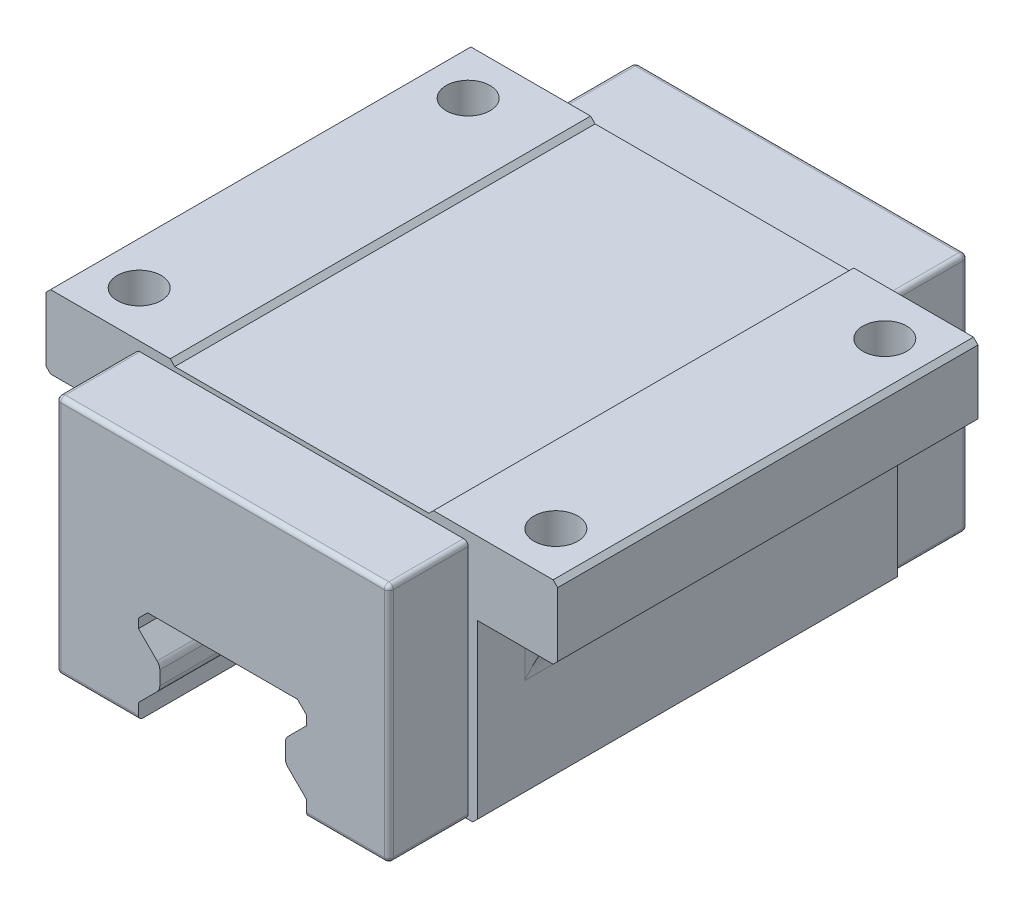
ISO-10303-21;
HEADER;
FILE_DESCRIPTION(('STEP AP214'),'2;1');
FILE_NAME('part.step','',(''),(''),'','','');
FILE_SCHEMA(('AUTOMOTIVE_DESIGN { 1 0 10303 214 1 1 1 1 }'));
ENDSEC;
DATA;
#1=APPLICATION_CONTEXT('core data for automotive mechanical design processes');
#2=APPLICATION_PROTOCOL_DEFINITION('international standard','automotive_design',2000,#1);
#3=PRODUCT_CONTEXT('',#1,'mechanical');
#4=PRODUCT('Part','Part','',(#3));
#5=PRODUCT_RELATED_PRODUCT_CATEGORY('part','',(#4));
#6=PRODUCT_DEFINITION_FORMATION('','',#4);
#7=PRODUCT_DEFINITION_CONTEXT('part definition',#1,'design');
#8=PRODUCT_DEFINITION('design','',#6,#7);
#9=PRODUCT_DEFINITION_SHAPE('','',#8);
#10=(LENGTH_UNIT() NAMED_UNIT(*) SI_UNIT(.MILLI.,.METRE.));
#11=(NAMED_UNIT(*) PLANE_ANGLE_UNIT() SI_UNIT($,.RADIAN.));
#12=(NAMED_UNIT(*) SI_UNIT($,.STERADIAN.) SOLID_ANGLE_UNIT());
#13=UNCERTAINTY_MEASURE_WITH_UNIT(LENGTH_MEASURE(1.E-05),#10,'distance_accuracy_value','');
#14=(GEOMETRIC_REPRESENTATION_CONTEXT(3) GLOBAL_UNCERTAINTY_ASSIGNED_CONTEXT((#13)) GLOBAL_UNIT_ASSIGNED_CONTEXT((#10,
#11,#12)) REPRESENTATION_CONTEXT('',''));
#15=CARTESIAN_POINT('',(0.,0.,0.));
#16=DIRECTION('',(0.,0.,1.));
#17=DIRECTION('',(1.,0.,0.));
#18=AXIS2_PLACEMENT_3D('',#15,#16,#17);
#19=CARTESIAN_POINT('',(35.,30.,16.25));
#20=DIRECTION('',(0.,1.,0.));
#21=DIRECTION('',(0.,0.,1.));
#22=AXIS2_PLACEMENT_3D('',#19,#20,#21);
#23=PLANE('',#22);
#24=CARTESIAN_POINT('',(28.5,30.,-22.5));
#25=DIRECTION('',(0.,-1.,0.));
#26=DIRECTION('',(-1.,0.,0.));
#27=AXIS2_PLACEMENT_3D('',#24,#25,#26);
#28=CIRCLE('',#27,3.);
#29=CARTESIAN_POINT('',(25.5,30.,-22.5));
#30=VERTEX_POINT('',#29);
#31=EDGE_CURVE('E1664',#30,#30,#28,.T.);
#32=ORIENTED_EDGE('',*,*,#31,.F.);
#33=EDGE_LOOP('',(#32));
#34=FACE_BOUND('',#33,.T.);
#35=DIRECTION('',(-1.,0.,0.));
#36=VECTOR('',#35,1.);
#37=CARTESIAN_POINT('',(34.38,30.,-16.25));
#38=LINE('',#37,#36);
#39=CARTESIAN_POINT('',(34.38,30.,-16.25));
#40=VERTEX_POINT('',#39);
#41=CARTESIAN_POINT('',(30.,30.,-16.25));
#42=VERTEX_POINT('',#41);
#43=EDGE_CURVE('E1638',#40,#42,#38,.T.);
#44=ORIENTED_EDGE('',*,*,#43,.T.);
#45=CARTESIAN_POINT('',(30.,30.,-22.25));
#46=DIRECTION('',(0.,1.,0.));
#47=DIRECTION('',(0.,0.,1.));
#48=AXIS2_PLACEMENT_3D('',#45,#46,#47);
#49=CIRCLE('',#48,6.);
#50=CARTESIAN_POINT('',(24.,30.,-22.25));
#51=VERTEX_POINT('',#50);
#52=EDGE_CURVE('E476',#42,#51,#49,.F.);
#53=ORIENTED_EDGE('',*,*,#52,.T.);
#54=DIRECTION('',(0.,0.,-1.));
#55=VECTOR('',#54,1.);
#56=CARTESIAN_POINT('',(24.,30.,28.75));
#57=LINE('',#56,#55);
#58=CARTESIAN_POINT('',(24.,30.,-28.75));
#59=VERTEX_POINT('',#58);
#60=EDGE_CURVE('E470',#51,#59,#57,.T.);
#61=ORIENTED_EDGE('',*,*,#60,.T.);
#62=DIRECTION('',(1.,0.,0.));
#63=VECTOR('',#62,1.);
#64=CARTESIAN_POINT('',(35.,30.,-28.75));
#65=LINE('',#64,#63);
#66=CARTESIAN_POINT('',(34.38,30.,-28.75));
#67=VERTEX_POINT('',#66);
#68=EDGE_CURVE('E474',#59,#67,#65,.T.);
#69=ORIENTED_EDGE('',*,*,#68,.T.);
#70=DIRECTION('',(0.,0.,1.));
#71=VECTOR('',#70,1.);
#72=CARTESIAN_POINT('',(34.38,30.,16.25));
#73=LINE('',#72,#71);
#74=EDGE_CURVE('E975',#67,#40,#73,.T.);
#75=ORIENTED_EDGE('',*,*,#74,.T.);
#76=EDGE_LOOP('',(#44,#53,#61,#69,#75));
#77=FACE_BOUND('',#76,.T.);
#78=ADVANCED_FACE('F38',(#34,#77),#23,.F.);
#79=CARTESIAN_POINT('',(-35.,30.,16.25));
#80=DIRECTION('',(0.,1.,0.));
#81=DIRECTION('',(0.,0.,1.));
#82=AXIS2_PLACEMENT_3D('',#79,#80,#81);
#83=PLANE('',#82);
#84=CARTESIAN_POINT('',(-28.5,30.,22.5));
#85=DIRECTION('',(0.,1.,0.));
#86=DIRECTION('',(-1.,0.,0.));
#87=AXIS2_PLACEMENT_3D('',#84,#85,#86);
#88=CIRCLE('',#87,3.);
#89=CARTESIAN_POINT('',(-31.5,30.,22.5));
#90=VERTEX_POINT('',#89);
#91=EDGE_CURVE('E494',#90,#90,#88,.T.);
#92=ORIENTED_EDGE('',*,*,#91,.T.);
#93=EDGE_LOOP('',(#92));
#94=FACE_BOUND('',#93,.T.);
#95=DIRECTION('',(1.,0.,0.));
#96=VECTOR('',#95,1.);
#97=CARTESIAN_POINT('',(-34.38,30.,16.25));
#98=LINE('',#97,#96);
#99=CARTESIAN_POINT('',(-34.38,30.,16.25));
#100=VERTEX_POINT('',#99);
#101=CARTESIAN_POINT('',(-30.,30.,16.25));
#102=VERTEX_POINT('',#101);
#103=EDGE_CURVE('E1358',#100,#102,#98,.T.);
#104=ORIENTED_EDGE('',*,*,#103,.T.);
#105=CARTESIAN_POINT('',(-30.,30.,22.25));
#106=DIRECTION('',(0.,1.,0.));
#107=DIRECTION('',(0.,0.,1.));
#108=AXIS2_PLACEMENT_3D('',#105,#106,#107);
#109=CIRCLE('',#108,6.);
#110=CARTESIAN_POINT('',(-24.,30.,22.25));
#111=VERTEX_POINT('',#110);
#112=EDGE_CURVE('E986',#102,#111,#109,.F.);
#113=ORIENTED_EDGE('',*,*,#112,.T.);
#114=DIRECTION('',(0.,0.,1.));
#115=VECTOR('',#114,1.);
#116=CARTESIAN_POINT('',(-24.,30.,28.75));
#117=LINE('',#116,#115);
#118=CARTESIAN_POINT('',(-24.,30.,28.75));
#119=VERTEX_POINT('',#118);
#120=EDGE_CURVE('E1362',#111,#119,#117,.T.);
#121=ORIENTED_EDGE('',*,*,#120,.T.);
#122=DIRECTION('',(1.,0.,0.));
#123=VECTOR('',#122,1.);
#124=CARTESIAN_POINT('',(-35.,30.,28.75));
#125=LINE('',#124,#123);
#126=CARTESIAN_POINT('',(-34.38,30.,28.75));
#127=VERTEX_POINT('',#126);
#128=EDGE_CURVE('E1343',#127,#119,#125,.T.);
#129=ORIENTED_EDGE('',*,*,#128,.F.);
#130=DIRECTION('',(0.,0.,-1.));
#131=VECTOR('',#130,1.);
#132=CARTESIAN_POINT('',(-34.38,30.,16.25));
#133=LINE('',#132,#131);
#134=EDGE_CURVE('E928',#127,#100,#133,.T.);
#135=ORIENTED_EDGE('',*,*,#134,.T.);
#136=EDGE_LOOP('',(#104,#113,#121,#129,#135));
#137=FACE_BOUND('',#136,.T.);
#138=ADVANCED_FACE('F1050',(#94,#137),#83,.F.);
#139=CARTESIAN_POINT('',(24.,5.8,28.75));
#140=DIRECTION('',(-1.,0.,0.));
#141=DIRECTION('',(0.,0.,1.));
#142=AXIS2_PLACEMENT_3D('',#139,#140,#141);
#143=PLANE('',#142);
#144=ORIENTED_EDGE('',*,*,#60,.F.);
#145=DIRECTION('',(0.,1.,0.));
#146=VECTOR('',#145,1.);
#147=CARTESIAN_POINT('',(24.,19.62,-22.25));
#148=LINE('',#147,#146);
#149=CARTESIAN_POINT('',(24.,19.62,-22.25));
#150=VERTEX_POINT('',#149);
#151=EDGE_CURVE('E1013',#51,#150,#148,.F.);
#152=ORIENTED_EDGE('',*,*,#151,.T.);
#153=DIRECTION('',(0.,0.,-1.));
#154=VECTOR('',#153,1.);
#155=CARTESIAN_POINT('',(24.,19.62,16.25));
#156=LINE('',#155,#154);
#157=CARTESIAN_POINT('',(24.,19.62,22.25));
#158=VERTEX_POINT('',#157);
#159=EDGE_CURVE('E1369',#158,#150,#156,.T.);
#160=ORIENTED_EDGE('',*,*,#159,.F.);
#161=DIRECTION('',(0.,1.,0.));
#162=VECTOR('',#161,1.);
#163=CARTESIAN_POINT('',(24.,5.8,22.25));
#164=LINE('',#163,#162);
#165=CARTESIAN_POINT('',(24.,30.,22.25));
#166=VERTEX_POINT('',#165);
#167=EDGE_CURVE('E1009',#158,#166,#164,.T.);
#168=ORIENTED_EDGE('',*,*,#167,.T.);
#169=CARTESIAN_POINT('',(24.,30.,28.75));
#170=VERTEX_POINT('',#169);
#171=EDGE_CURVE('E482',#170,#166,#57,.T.);
#172=ORIENTED_EDGE('',*,*,#171,.F.);
#173=DIRECTION('',(0.,1.,0.));
#174=VECTOR('',#173,1.);
#175=CARTESIAN_POINT('',(24.,5.8,28.75));
#176=LINE('',#175,#174);
#177=CARTESIAN_POINT('',(24.,6.42,28.75));
#178=VERTEX_POINT('',#177);
#179=EDGE_CURVE('E526',#178,#170,#176,.T.);
#180=ORIENTED_EDGE('',*,*,#179,.F.);
#181=DIRECTION('',(0.,0.,-1.));
#182=VECTOR('',#181,1.);
#183=CARTESIAN_POINT('',(24.,6.42,28.75));
#184=LINE('',#183,#182);
#185=CARTESIAN_POINT('',(24.,6.42,-28.75));
#186=VERTEX_POINT('',#185);
#187=EDGE_CURVE('E500',#178,#186,#184,.T.);
#188=ORIENTED_EDGE('',*,*,#187,.T.);
#189=DIRECTION('',(0.,1.,0.));
#190=VECTOR('',#189,1.);
#191=CARTESIAN_POINT('',(24.,5.8,-28.75));
#192=LINE('',#191,#190);
#193=EDGE_CURVE('E489',#186,#59,#192,.T.);
#194=ORIENTED_EDGE('',*,*,#193,.T.);
#195=EDGE_LOOP('',(#144,#152,#160,#168,#172,#180,#188,#194));
#196=FACE_BOUND('',#195,.T.);
#197=ADVANCED_FACE('F497',(#196),#143,.F.);
#198=CARTESIAN_POINT('',(34.38,19.62,16.25));
#199=DIRECTION('',(0.,0.,1.));
#200=DIRECTION('',(1.,0.,0.));
#201=AXIS2_PLACEMENT_3D('',#198,#199,#200);
#202=PLANE('',#201);
#203=DIRECTION('',(-1.,0.,0.));
#204=VECTOR('',#203,1.);
#205=CARTESIAN_POINT('',(34.38,30.,16.25));
#206=LINE('',#205,#204);
#207=CARTESIAN_POINT('',(34.38,30.,16.25));
#208=VERTEX_POINT('',#207);
#209=CARTESIAN_POINT('',(30.,30.,16.25));
#210=VERTEX_POINT('',#209);
#211=EDGE_CURVE('E483',#208,#210,#206,.T.);
#212=ORIENTED_EDGE('',*,*,#211,.T.);
#213=DIRECTION('',(0.,1.,0.));
#214=VECTOR('',#213,1.);
#215=CARTESIAN_POINT('',(30.,19.62,16.25));
#216=LINE('',#215,#214);
#217=CARTESIAN_POINT('',(30.,29.0306322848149,16.25));
#218=VERTEX_POINT('',#217);
#219=EDGE_CURVE('E59',#210,#218,#216,.F.);
#220=ORIENTED_EDGE('',*,*,#219,.T.);
#221=CARTESIAN_POINT('',(34.38,19.62,16.25));
#222=DIRECTION('',(0.,0.,-1.));
#223=DIRECTION('',(1.,0.,0.));
#224=AXIS2_PLACEMENT_3D('',#221,#222,#223);
#225=CIRCLE('',#224,10.38);
#226=EDGE_CURVE('E1366',#218,#208,#225,.T.);
#227=ORIENTED_EDGE('',*,*,#226,.T.);
#228=EDGE_LOOP('',(#212,#220,#227));
#229=FACE_BOUND('',#228,.T.);
#230=ADVANCED_FACE('F1147',(#229),#202,.T.);
#231=CARTESIAN_POINT('',(34.38,19.62,-16.25));
#232=DIRECTION('',(0.,0.,1.));
#233=DIRECTION('',(1.,0.,0.));
#234=AXIS2_PLACEMENT_3D('',#231,#232,#233);
#235=PLANE('',#234);
#236=CARTESIAN_POINT('',(34.38,19.62,-16.25));
#237=DIRECTION('',(0.,0.,-1.));
#238=DIRECTION('',(1.,0.,0.));
#239=AXIS2_PLACEMENT_3D('',#236,#237,#238);
#240=CIRCLE('',#239,10.38);
#241=CARTESIAN_POINT('',(30.,29.0306322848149,-16.25));
#242=VERTEX_POINT('',#241);
#243=EDGE_CURVE('E1370',#242,#40,#240,.T.);
#244=ORIENTED_EDGE('',*,*,#243,.F.);
#245=DIRECTION('',(0.,1.,0.));
#246=VECTOR('',#245,1.);
#247=CARTESIAN_POINT('',(30.,30.,-16.25));
#248=LINE('',#247,#246);
#249=EDGE_CURVE('E1003',#242,#42,#248,.T.);
#250=ORIENTED_EDGE('',*,*,#249,.T.);
#251=ORIENTED_EDGE('',*,*,#43,.F.);
#252=EDGE_LOOP('',(#244,#250,#251));
#253=FACE_BOUND('',#252,.T.);
#254=ADVANCED_FACE('F1139',(#253),#235,.F.);
#255=CARTESIAN_POINT('',(-24.,5.8,28.75));
#256=DIRECTION('',(1.,0.,0.));
#257=DIRECTION('',(0.,0.,-1.));
#258=AXIS2_PLACEMENT_3D('',#255,#256,#257);
#259=PLANE('',#258);
#260=ORIENTED_EDGE('',*,*,#120,.F.);
#261=DIRECTION('',(0.,1.,0.));
#262=VECTOR('',#261,1.);
#263=CARTESIAN_POINT('',(-24.,19.62,22.25));
#264=LINE('',#263,#262);
#265=CARTESIAN_POINT('',(-24.,19.62,22.25));
#266=VERTEX_POINT('',#265);
#267=EDGE_CURVE('E993',#111,#266,#264,.F.);
#268=ORIENTED_EDGE('',*,*,#267,.T.);
#269=DIRECTION('',(0.,0.,-1.));
#270=VECTOR('',#269,1.);
#271=CARTESIAN_POINT('',(-24.,19.62,16.25));
#272=LINE('',#271,#270);
#273=CARTESIAN_POINT('',(-24.,19.62,-22.25));
#274=VERTEX_POINT('',#273);
#275=EDGE_CURVE('E1384',#266,#274,#272,.T.);
#276=ORIENTED_EDGE('',*,*,#275,.T.);
#277=DIRECTION('',(0.,1.,0.));
#278=VECTOR('',#277,1.);
#279=CARTESIAN_POINT('',(-24.,5.8,-22.25));
#280=LINE('',#279,#278);
#281=CARTESIAN_POINT('',(-24.,30.,-22.25));
#282=VERTEX_POINT('',#281);
#283=EDGE_CURVE('E989',#274,#282,#280,.T.);
#284=ORIENTED_EDGE('',*,*,#283,.T.);
#285=CARTESIAN_POINT('',(-24.,30.,-28.75));
#286=VERTEX_POINT('',#285);
#287=EDGE_CURVE('E1365',#286,#282,#117,.T.);
#288=ORIENTED_EDGE('',*,*,#287,.F.);
#289=DIRECTION('',(0.,-1.,0.));
#290=VECTOR('',#289,1.);
#291=CARTESIAN_POINT('',(-24.,5.8,-28.75));
#292=LINE('',#291,#290);
#293=CARTESIAN_POINT('',(-24.,6.41999999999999,-28.75));
#294=VERTEX_POINT('',#293);
#295=EDGE_CURVE('E519',#286,#294,#292,.T.);
#296=ORIENTED_EDGE('',*,*,#295,.T.);
#297=DIRECTION('',(0.,0.,1.));
#298=VECTOR('',#297,1.);
#299=CARTESIAN_POINT('',(-24.,6.41999999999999,28.75));
#300=LINE('',#299,#298);
#301=CARTESIAN_POINT('',(-24.,6.41999999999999,28.75));
#302=VERTEX_POINT('',#301);
#303=EDGE_CURVE('E653',#294,#302,#300,.T.);
#304=ORIENTED_EDGE('',*,*,#303,.T.);
#305=DIRECTION('',(0.,-1.,0.));
#306=VECTOR('',#305,1.);
#307=CARTESIAN_POINT('',(-24.,5.8,28.75));
#308=LINE('',#307,#306);
#309=EDGE_CURVE('E1499',#119,#302,#308,.T.);
#310=ORIENTED_EDGE('',*,*,#309,.F.);
#311=EDGE_LOOP('',(#260,#268,#276,#284,#288,#296,#304,#310));
#312=FACE_BOUND('',#311,.T.);
#313=ADVANCED_FACE('F1135',(#312),#259,.F.);
#314=CARTESIAN_POINT('',(-34.38,19.62,16.25));
#315=DIRECTION('',(0.,0.,-1.));
#316=DIRECTION('',(-1.,0.,0.));
#317=AXIS2_PLACEMENT_3D('',#314,#315,#316);
#318=PLANE('',#317);
#319=CARTESIAN_POINT('',(-34.38,19.62,16.25));
#320=DIRECTION('',(0.,0.,-1.));
#321=DIRECTION('',(-1.,0.,0.));
#322=AXIS2_PLACEMENT_3D('',#319,#320,#321);
#323=CIRCLE('',#322,10.38);
#324=CARTESIAN_POINT('',(-30.,29.0306322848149,16.25));
#325=VERTEX_POINT('',#324);
#326=EDGE_CURVE('E1380',#100,#325,#323,.T.);
#327=ORIENTED_EDGE('',*,*,#326,.T.);
#328=DIRECTION('',(0.,1.,0.));
#329=VECTOR('',#328,1.);
#330=CARTESIAN_POINT('',(-30.,30.,16.25));
#331=LINE('',#330,#329);
#332=EDGE_CURVE('E982',#325,#102,#331,.T.);
#333=ORIENTED_EDGE('',*,*,#332,.T.);
#334=ORIENTED_EDGE('',*,*,#103,.F.);
#335=EDGE_LOOP('',(#327,#333,#334));
#336=FACE_BOUND('',#335,.T.);
#337=ADVANCED_FACE('F1138',(#336),#318,.F.);
#338=CARTESIAN_POINT('',(-34.38,19.62,-16.25));
#339=DIRECTION('',(0.,0.,-1.));
#340=DIRECTION('',(-1.,0.,0.));
#341=AXIS2_PLACEMENT_3D('',#338,#339,#340);
#342=PLANE('',#341);
#343=DIRECTION('',(1.,0.,0.));
#344=VECTOR('',#343,1.);
#345=CARTESIAN_POINT('',(-34.38,30.,-16.25));
#346=LINE('',#345,#344);
#347=CARTESIAN_POINT('',(-34.38,30.,-16.25));
#348=VERTEX_POINT('',#347);
#349=CARTESIAN_POINT('',(-30.,30.,-16.25));
#350=VERTEX_POINT('',#349);
#351=EDGE_CURVE('E1350',#348,#350,#346,.T.);
#352=ORIENTED_EDGE('',*,*,#351,.T.);
#353=DIRECTION('',(0.,1.,0.));
#354=VECTOR('',#353,1.);
#355=CARTESIAN_POINT('',(-30.,19.62,-16.25));
#356=LINE('',#355,#354);
#357=CARTESIAN_POINT('',(-30.,29.0306322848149,-16.25));
#358=VERTEX_POINT('',#357);
#359=EDGE_CURVE('E1000',#350,#358,#356,.F.);
#360=ORIENTED_EDGE('',*,*,#359,.T.);
#361=CARTESIAN_POINT('',(-34.38,19.62,-16.25));
#362=DIRECTION('',(0.,0.,-1.));
#363=DIRECTION('',(-1.,0.,0.));
#364=AXIS2_PLACEMENT_3D('',#361,#362,#363);
#365=CIRCLE('',#364,10.38);
#366=EDGE_CURVE('E1379',#348,#358,#365,.T.);
#367=ORIENTED_EDGE('',*,*,#366,.F.);
#368=EDGE_LOOP('',(#352,#360,#367));
#369=FACE_BOUND('',#368,.T.);
#370=ADVANCED_FACE('F1043',(#369),#342,.T.);
#371=CARTESIAN_POINT('',(-24.,40.,28.75));
#372=DIRECTION('',(0.,-1.,0.));
#373=DIRECTION('',(1.,0.,0.));
#374=AXIS2_PLACEMENT_3D('',#371,#372,#373);
#375=PLANE('',#374);
#376=CARTESIAN_POINT('',(-28.5,40.,-22.5));
#377=DIRECTION('',(0.,-1.,0.));
#378=DIRECTION('',(-1.,0.,0.));
#379=AXIS2_PLACEMENT_3D('',#376,#377,#378);
#380=CIRCLE('',#379,3.);
#381=CARTESIAN_POINT('',(-31.5,40.,-22.5));
#382=VERTEX_POINT('',#381);
#383=EDGE_CURVE('E1668',#382,#382,#380,.T.);
#384=ORIENTED_EDGE('',*,*,#383,.T.);
#385=EDGE_LOOP('',(#384));
#386=FACE_BOUND('',#385,.T.);
#387=CARTESIAN_POINT('',(-28.5,40.,22.5));
#388=DIRECTION('',(0.,1.,0.));
#389=DIRECTION('',(-1.,0.,0.));
#390=AXIS2_PLACEMENT_3D('',#387,#388,#389);
#391=CIRCLE('',#390,3.);
#392=CARTESIAN_POINT('',(-31.5,40.,22.5));
#393=VERTEX_POINT('',#392);
#394=EDGE_CURVE('E1647',#393,#393,#391,.T.);
#395=ORIENTED_EDGE('',*,*,#394,.F.);
#396=EDGE_LOOP('',(#395));
#397=FACE_BOUND('',#396,.T.);
#398=DIRECTION('',(-1.,0.,0.));
#399=VECTOR('',#398,1.);
#400=CARTESIAN_POINT('',(-24.,40.,-28.75));
#401=LINE('',#400,#399);
#402=CARTESIAN_POINT('',(-18.,40.,-28.75));
#403=VERTEX_POINT('',#402);
#404=CARTESIAN_POINT('',(-34.38,40.,-28.75));
#405=VERTEX_POINT('',#404);
#406=EDGE_CURVE('E502',#403,#405,#401,.T.);
#407=ORIENTED_EDGE('',*,*,#406,.T.);
#408=DIRECTION('',(0.,0.,1.));
#409=VECTOR('',#408,1.);
#410=CARTESIAN_POINT('',(-34.38,40.,28.75));
#411=LINE('',#410,#409);
#412=CARTESIAN_POINT('',(-34.38,40.,28.75));
#413=VERTEX_POINT('',#412);
#414=EDGE_CURVE('E962',#405,#413,#411,.T.);
#415=ORIENTED_EDGE('',*,*,#414,.T.);
#416=DIRECTION('',(-1.,0.,0.));
#417=VECTOR('',#416,1.);
#418=CARTESIAN_POINT('',(-24.,40.,28.75));
#419=LINE('',#418,#417);
#420=CARTESIAN_POINT('',(-18.,40.,28.75));
#421=VERTEX_POINT('',#420);
#422=EDGE_CURVE('E1496',#421,#413,#419,.T.);
#423=ORIENTED_EDGE('',*,*,#422,.F.);
#424=DIRECTION('',(0.,0.,-1.));
#425=VECTOR('',#424,1.);
#426=CARTESIAN_POINT('',(-18.,40.,28.75));
#427=LINE('',#426,#425);
#428=EDGE_CURVE('E624',#421,#403,#427,.T.);
#429=ORIENTED_EDGE('',*,*,#428,.T.);
#430=EDGE_LOOP('',(#407,#415,#423,#429));
#431=FACE_BOUND('',#430,.T.);
#432=ADVANCED_FACE('F1144',(#386,#397,#431),#375,.F.);
#433=CARTESIAN_POINT('',(11.5,19.2,-39.6));
#434=DIRECTION('',(1.,0.,0.));
#435=DIRECTION('',(0.,1.,0.));
#436=AXIS2_PLACEMENT_3D('',#433,#434,#435);
#437=PLANE('',#436);
#438=DIRECTION('',(0.,-1.,0.));
#439=VECTOR('',#438,1.);
#440=CARTESIAN_POINT('',(11.5,0.,39.6));
#441=LINE('',#440,#439);
#442=CARTESIAN_POINT('',(11.5,17.95,39.6));
#443=VERTEX_POINT('',#442);
#444=CARTESIAN_POINT('',(11.5,16.7,39.6));
#445=VERTEX_POINT('',#444);
#446=EDGE_CURVE('E539',#443,#445,#441,.T.);
#447=ORIENTED_EDGE('',*,*,#446,.F.);
#448=DIRECTION('',(0.,0.,-1.));
#449=VECTOR('',#448,1.);
#450=CARTESIAN_POINT('',(11.5,17.95,-39.6));
#451=LINE('',#450,#449);
#452=CARTESIAN_POINT('',(11.5,17.95,-39.6));
#453=VERTEX_POINT('',#452);
#454=EDGE_CURVE('E549',#443,#453,#451,.T.);
#455=ORIENTED_EDGE('',*,*,#454,.T.);
#456=DIRECTION('',(0.,1.,0.));
#457=VECTOR('',#456,1.);
#458=CARTESIAN_POINT('',(11.5,19.2,-39.6));
#459=LINE('',#458,#457);
#460=CARTESIAN_POINT('',(11.5,16.7,-39.6));
#461=VERTEX_POINT('',#460);
#462=EDGE_CURVE('E1462',#461,#453,#459,.T.);
#463=ORIENTED_EDGE('',*,*,#462,.F.);
#464=DIRECTION('',(0.,0.,1.));
#465=VECTOR('',#464,1.);
#466=CARTESIAN_POINT('',(11.5,16.7,-48.8233098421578));
#467=LINE('',#466,#465);
#468=EDGE_CURVE('E1401',#461,#445,#467,.T.);
#469=ORIENTED_EDGE('',*,*,#468,.T.);
#470=EDGE_LOOP('',(#447,#455,#463,#469));
#471=FACE_BOUND('',#470,.T.);
#472=ADVANCED_FACE('F1100',(#471),#437,.F.);
#473=CARTESIAN_POINT('',(-11.5,19.2,-39.6));
#474=DIRECTION('',(-1.,0.,0.));
#475=DIRECTION('',(0.,-1.,0.));
#476=AXIS2_PLACEMENT_3D('',#473,#474,#475);
#477=PLANE('',#476);
#478=DIRECTION('',(0.,-1.,0.));
#479=VECTOR('',#478,1.);
#480=CARTESIAN_POINT('',(-11.5,19.2,39.6));
#481=LINE('',#480,#479);
#482=CARTESIAN_POINT('',(-11.5,7.95,39.6));
#483=VERTEX_POINT('',#482);
#484=CARTESIAN_POINT('',(-11.5,6.42,39.6));
#485=VERTEX_POINT('',#484);
#486=EDGE_CURVE('E1475',#483,#485,#481,.T.);
#487=ORIENTED_EDGE('',*,*,#486,.T.);
#488=CARTESIAN_POINT('',(-11.5,6.42,38.98));
#489=DIRECTION('',(-1.,0.,0.));
#490=DIRECTION('',(0.,-1.,0.));
#491=AXIS2_PLACEMENT_3D('',#488,#489,#490);
#492=CIRCLE('',#491,0.62);
#493=CARTESIAN_POINT('',(-11.5,5.8,38.98));
#494=VERTEX_POINT('',#493);
#495=EDGE_CURVE('E762',#485,#494,#492,.F.);
#496=ORIENTED_EDGE('',*,*,#495,.T.);
#497=DIRECTION('',(0.,0.,1.));
#498=VECTOR('',#497,1.);
#499=CARTESIAN_POINT('',(-11.5,5.8,28.75));
#500=LINE('',#499,#498);
#501=CARTESIAN_POINT('',(-11.5,5.8,-38.98));
#502=VERTEX_POINT('',#501);
#503=EDGE_CURVE('E1471',#502,#494,#500,.T.);
#504=ORIENTED_EDGE('',*,*,#503,.F.);
#505=CARTESIAN_POINT('',(-11.5,6.42,-38.98));
#506=DIRECTION('',(-1.,0.,0.));
#507=DIRECTION('',(0.,-1.,0.));
#508=AXIS2_PLACEMENT_3D('',#505,#506,#507);
#509=CIRCLE('',#508,0.62);
#510=CARTESIAN_POINT('',(-11.5,6.42,-39.6));
#511=VERTEX_POINT('',#510);
#512=EDGE_CURVE('E759',#502,#511,#509,.F.);
#513=ORIENTED_EDGE('',*,*,#512,.T.);
#514=DIRECTION('',(0.,-1.,0.));
#515=VECTOR('',#514,1.);
#516=CARTESIAN_POINT('',(-11.5,19.2,-39.6));
#517=LINE('',#516,#515);
#518=CARTESIAN_POINT('',(-11.5,7.95,-39.6));
#519=VERTEX_POINT('',#518);
#520=EDGE_CURVE('E1466',#519,#511,#517,.T.);
#521=ORIENTED_EDGE('',*,*,#520,.F.);
#522=DIRECTION('',(0.,0.,1.));
#523=VECTOR('',#522,1.);
#524=CARTESIAN_POINT('',(-11.5,7.95,-48.8233098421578));
#525=LINE('',#524,#523);
#526=EDGE_CURVE('E1432',#519,#483,#525,.T.);
#527=ORIENTED_EDGE('',*,*,#526,.T.);
#528=EDGE_LOOP('',(#487,#496,#504,#513,#521,#527));
#529=FACE_BOUND('',#528,.T.);
#530=ADVANCED_FACE('F1092',(#529),#477,.F.);
#531=CARTESIAN_POINT('',(-24.,5.8,28.75));
#532=DIRECTION('',(0.,1.,0.));
#533=DIRECTION('',(-1.,0.,0.));
#534=AXIS2_PLACEMENT_3D('',#531,#532,#533);
#535=PLANE('',#534);
#536=DIRECTION('',(0.,0.,-1.));
#537=VECTOR('',#536,1.);
#538=CARTESIAN_POINT('',(22.13,5.8,28.75));
#539=LINE('',#538,#537);
#540=CARTESIAN_POINT('',(22.13,5.8,28.75));
#541=VERTEX_POINT('',#540);
#542=CARTESIAN_POINT('',(22.13,5.8,38.98));
#543=VERTEX_POINT('',#542);
#544=EDGE_CURVE('E708',#541,#543,#539,.F.);
#545=ORIENTED_EDGE('',*,*,#544,.T.);
#546=DIRECTION('',(1.,0.,0.));
#547=VECTOR('',#546,1.);
#548=CARTESIAN_POINT('',(-24.,5.8,38.98));
#549=LINE('',#548,#547);
#550=CARTESIAN_POINT('',(11.5,5.8,38.98));
#551=VERTEX_POINT('',#550);
#552=EDGE_CURVE('E711',#543,#551,#549,.F.);
#553=ORIENTED_EDGE('',*,*,#552,.T.);
#554=DIRECTION('',(0.,0.,-1.));
#555=VECTOR('',#554,1.);
#556=CARTESIAN_POINT('',(11.5,5.8,28.75));
#557=LINE('',#556,#555);
#558=CARTESIAN_POINT('',(11.5,5.8,-38.98));
#559=VERTEX_POINT('',#558);
#560=EDGE_CURVE('E1483',#551,#559,#557,.T.);
#561=ORIENTED_EDGE('',*,*,#560,.T.);
#562=DIRECTION('',(1.,0.,0.));
#563=VECTOR('',#562,1.);
#564=CARTESIAN_POINT('',(22.75,5.8,-38.98));
#565=LINE('',#564,#563);
#566=CARTESIAN_POINT('',(22.13,5.8,-38.98));
#567=VERTEX_POINT('',#566);
#568=EDGE_CURVE('E705',#559,#567,#565,.T.);
#569=ORIENTED_EDGE('',*,*,#568,.T.);
#570=DIRECTION('',(0.,0.,-1.));
#571=VECTOR('',#570,1.);
#572=CARTESIAN_POINT('',(22.13,5.8,28.75));
#573=LINE('',#572,#571);
#574=CARTESIAN_POINT('',(22.13,5.8,-28.75));
#575=VERTEX_POINT('',#574);
#576=EDGE_CURVE('E701',#567,#575,#573,.F.);
#577=ORIENTED_EDGE('',*,*,#576,.T.);
#578=DIRECTION('',(1.,0.,0.));
#579=VECTOR('',#578,1.);
#580=CARTESIAN_POINT('',(-24.,5.8,-28.75));
#581=LINE('',#580,#579);
#582=CARTESIAN_POINT('',(23.38,5.8,-28.75));
#583=VERTEX_POINT('',#582);
#584=EDGE_CURVE('E522',#575,#583,#581,.T.);
#585=ORIENTED_EDGE('',*,*,#584,.T.);
#586=DIRECTION('',(0.,0.,1.));
#587=VECTOR('',#586,1.);
#588=CARTESIAN_POINT('',(23.38,5.8,28.75));
#589=LINE('',#588,#587);
#590=CARTESIAN_POINT('',(23.38,5.8,28.75));
#591=VERTEX_POINT('',#590);
#592=EDGE_CURVE('E646',#583,#591,#589,.T.);
#593=ORIENTED_EDGE('',*,*,#592,.T.);
#594=DIRECTION('',(1.,0.,0.));
#595=VECTOR('',#594,1.);
#596=CARTESIAN_POINT('',(-24.,5.8,28.75));
#597=LINE('',#596,#595);
#598=EDGE_CURVE('E1501',#541,#591,#597,.T.);
#599=ORIENTED_EDGE('',*,*,#598,.F.);
#600=EDGE_LOOP('',(#545,#553,#561,#569,#577,#585,#593,#599));
#601=FACE_BOUND('',#600,.T.);
#602=ADVANCED_FACE('F1127',(#601),#535,.F.);
#603=CARTESIAN_POINT('',(0.,0.,28.75));
#604=DIRECTION('',(0.,0.,-1.));
#605=DIRECTION('',(-1.,0.,0.));
#606=AXIS2_PLACEMENT_3D('',#603,#604,#605);
#607=PLANE('',#606);
#608=DIRECTION('',(0.,-1.,0.));
#609=VECTOR('',#608,1.);
#610=CARTESIAN_POINT('',(-35.,30.,28.75));
#611=LINE('',#610,#609);
#612=CARTESIAN_POINT('',(-35.,39.38,28.75));
#613=VERTEX_POINT('',#612);
#614=CARTESIAN_POINT('',(-35.,30.62,28.75));
#615=VERTEX_POINT('',#614);
#616=EDGE_CURVE('E1347',#613,#615,#611,.T.);
#617=ORIENTED_EDGE('',*,*,#616,.T.);
#618=DIRECTION('',(-0.70710678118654,0.707106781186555,0.));
#619=VECTOR('',#618,1.);
#620=CARTESIAN_POINT('',(-34.38,30.,28.75));
#621=LINE('',#620,#619);
#622=EDGE_CURVE('E959',#615,#127,#621,.F.);
#623=ORIENTED_EDGE('',*,*,#622,.T.);
#624=ORIENTED_EDGE('',*,*,#128,.T.);
#625=ORIENTED_EDGE('',*,*,#309,.T.);
#626=DIRECTION('',(-0.70710678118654,0.707106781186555,0.));
#627=VECTOR('',#626,1.);
#628=CARTESIAN_POINT('',(-23.38,5.8,28.75));
#629=LINE('',#628,#627);
#630=CARTESIAN_POINT('',(-23.38,5.8,28.75));
#631=VERTEX_POINT('',#630);
#632=EDGE_CURVE('E640',#302,#631,#629,.F.);
#633=ORIENTED_EDGE('',*,*,#632,.T.);
#634=CARTESIAN_POINT('',(-22.13,5.8,28.75));
#635=VERTEX_POINT('',#634);
#636=EDGE_CURVE('E515',#631,#635,#597,.T.);
#637=ORIENTED_EDGE('',*,*,#636,.T.);
#638=CARTESIAN_POINT('',(-22.13,6.42,28.75));
#639=DIRECTION('',(0.,0.,-1.));
#640=DIRECTION('',(-1.,0.,0.));
#641=AXIS2_PLACEMENT_3D('',#638,#639,#640);
#642=CIRCLE('',#641,0.62);
#643=CARTESIAN_POINT('',(-22.75,6.42,28.75));
#644=VERTEX_POINT('',#643);
#645=EDGE_CURVE('E805',#635,#644,#642,.T.);
#646=ORIENTED_EDGE('',*,*,#645,.T.);
#647=DIRECTION('',(0.,-1.,0.));
#648=VECTOR('',#647,1.);
#649=CARTESIAN_POINT('',(-22.75,0.,28.75));
#650=LINE('',#649,#648);
#651=CARTESIAN_POINT('',(-22.75,38.13,28.75));
#652=VERTEX_POINT('',#651);
#653=EDGE_CURVE('E503',#652,#644,#650,.T.);
#654=ORIENTED_EDGE('',*,*,#653,.F.);
#655=CARTESIAN_POINT('',(-22.13,38.13,28.75));
#656=DIRECTION('',(0.,0.,-1.));
#657=DIRECTION('',(-1.,0.,0.));
#658=AXIS2_PLACEMENT_3D('',#655,#656,#657);
#659=CIRCLE('',#658,0.62);
#660=CARTESIAN_POINT('',(-22.13,38.75,28.75));
#661=VERTEX_POINT('',#660);
#662=EDGE_CURVE('E813',#652,#661,#659,.T.);
#663=ORIENTED_EDGE('',*,*,#662,.T.);
#664=DIRECTION('',(-1.,0.,0.));
#665=VECTOR('',#664,1.);
#666=CARTESIAN_POINT('',(0.,38.75,28.75));
#667=LINE('',#666,#665);
#668=CARTESIAN_POINT('',(22.13,38.75,28.75));
#669=VERTEX_POINT('',#668);
#670=EDGE_CURVE('E1487',#669,#661,#667,.T.);
#671=ORIENTED_EDGE('',*,*,#670,.F.);
#672=CARTESIAN_POINT('',(22.13,38.13,28.75));
#673=DIRECTION('',(0.,0.,-1.));
#674=DIRECTION('',(-1.,0.,0.));
#675=AXIS2_PLACEMENT_3D('',#672,#673,#674);
#676=CIRCLE('',#675,0.62);
#677=CARTESIAN_POINT('',(22.75,38.13,28.75));
#678=VERTEX_POINT('',#677);
#679=EDGE_CURVE('E816',#669,#678,#676,.T.);
#680=ORIENTED_EDGE('',*,*,#679,.T.);
#681=DIRECTION('',(0.,1.,0.));
#682=VECTOR('',#681,1.);
#683=CARTESIAN_POINT('',(22.75,0.,28.75));
#684=LINE('',#683,#682);
#685=CARTESIAN_POINT('',(22.75,6.42,28.75));
#686=VERTEX_POINT('',#685);
#687=EDGE_CURVE('E512',#686,#678,#684,.T.);
#688=ORIENTED_EDGE('',*,*,#687,.F.);
#689=CARTESIAN_POINT('',(22.13,6.42,28.75));
#690=DIRECTION('',(0.,0.,-1.));
#691=DIRECTION('',(-1.,0.,0.));
#692=AXIS2_PLACEMENT_3D('',#689,#690,#691);
#693=CIRCLE('',#692,0.62);
#694=EDGE_CURVE('E809',#686,#541,#693,.T.);
#695=ORIENTED_EDGE('',*,*,#694,.T.);
#696=ORIENTED_EDGE('',*,*,#598,.T.);
#697=DIRECTION('',(-0.707106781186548,-0.707106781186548,0.));
#698=VECTOR('',#697,1.);
#699=CARTESIAN_POINT('',(24.,6.42,28.75));
#700=LINE('',#699,#698);
#701=EDGE_CURVE('E643',#591,#178,#700,.F.);
#702=ORIENTED_EDGE('',*,*,#701,.T.);
#703=ORIENTED_EDGE('',*,*,#179,.T.);
#704=DIRECTION('',(1.,0.,0.));
#705=VECTOR('',#704,1.);
#706=CARTESIAN_POINT('',(35.,30.,28.75));
#707=LINE('',#706,#705);
#708=CARTESIAN_POINT('',(34.38,30.,28.75));
#709=VERTEX_POINT('',#708);
#710=EDGE_CURVE('E1332',#170,#709,#707,.T.);
#711=ORIENTED_EDGE('',*,*,#710,.T.);
#712=DIRECTION('',(-0.707106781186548,-0.707106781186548,0.));
#713=VECTOR('',#712,1.);
#714=CARTESIAN_POINT('',(35.,30.62,28.75));
#715=LINE('',#714,#713);
#716=CARTESIAN_POINT('',(35.,30.62,28.75));
#717=VERTEX_POINT('',#716);
#718=EDGE_CURVE('E953',#709,#717,#715,.F.);
#719=ORIENTED_EDGE('',*,*,#718,.T.);
#720=DIRECTION('',(0.,1.,0.));
#721=VECTOR('',#720,1.);
#722=CARTESIAN_POINT('',(35.,30.,28.75));
#723=LINE('',#722,#721);
#724=CARTESIAN_POINT('',(35.,39.38,28.75));
#725=VERTEX_POINT('',#724);
#726=EDGE_CURVE('E1634',#717,#725,#723,.T.);
#727=ORIENTED_EDGE('',*,*,#726,.T.);
#728=DIRECTION('',(0.707106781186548,-0.707106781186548,0.));
#729=VECTOR('',#728,1.);
#730=CARTESIAN_POINT('',(34.38,40.,28.75));
#731=LINE('',#730,#729);
#732=CARTESIAN_POINT('',(34.38,40.,28.75));
#733=VERTEX_POINT('',#732);
#734=EDGE_CURVE('E950',#725,#733,#731,.F.);
#735=ORIENTED_EDGE('',*,*,#734,.T.);
#736=CARTESIAN_POINT('',(18.,40.,28.75));
#737=VERTEX_POINT('',#736);
#738=EDGE_CURVE('E1497',#733,#737,#419,.T.);
#739=ORIENTED_EDGE('',*,*,#738,.T.);
#740=DIRECTION('',(0.70710678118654,0.707106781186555,0.));
#741=VECTOR('',#740,1.);
#742=CARTESIAN_POINT('',(-10.9999999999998,10.9999999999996,28.75));
#743=LINE('',#742,#741);
#744=CARTESIAN_POINT('',(17.38,39.38,28.75));
#745=VERTEX_POINT('',#744);
#746=EDGE_CURVE('E664',#737,#745,#743,.F.);
#747=ORIENTED_EDGE('',*,*,#746,.T.);
#748=DIRECTION('',(1.,0.,0.));
#749=VECTOR('',#748,1.);
#750=CARTESIAN_POINT('',(-18.,39.38,28.75));
#751=LINE('',#750,#749);
#752=CARTESIAN_POINT('',(-17.38,39.38,28.75));
#753=VERTEX_POINT('',#752);
#754=EDGE_CURVE('E877',#753,#745,#751,.T.);
#755=ORIENTED_EDGE('',*,*,#754,.F.);
#756=DIRECTION('',(0.707106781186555,-0.70710678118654,0.));
#757=VECTOR('',#756,1.);
#758=CARTESIAN_POINT('',(11.0000000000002,11.0000000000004,28.75));
#759=LINE('',#758,#757);
#760=EDGE_CURVE('E671',#753,#421,#759,.F.);
#761=ORIENTED_EDGE('',*,*,#760,.T.);
#762=ORIENTED_EDGE('',*,*,#422,.T.);
#763=DIRECTION('',(0.70710678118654,0.707106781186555,0.));
#764=VECTOR('',#763,1.);
#765=CARTESIAN_POINT('',(-35.,39.38,28.75));
#766=LINE('',#765,#764);
#767=EDGE_CURVE('E956',#413,#613,#766,.F.);
#768=ORIENTED_EDGE('',*,*,#767,.T.);
#769=EDGE_LOOP('',(#617,#623,#624,#625,#633,#637,#646,#654,#663,#671,#680,#688,#695,#696,#702,
#703,#711,#719,#727,#735,#739,#747,#755,#761,#762,#768));
#770=FACE_BOUND('',#769,.T.);
#771=ADVANCED_FACE('F1124',(#770),#607,.F.);
#772=CARTESIAN_POINT('',(0.,0.,-28.75));
#773=DIRECTION('',(0.,0.,-1.));
#774=DIRECTION('',(-1.,0.,0.));
#775=AXIS2_PLACEMENT_3D('',#772,#773,#774);
#776=PLANE('',#775);
#777=DIRECTION('',(1.,0.,0.));
#778=VECTOR('',#777,1.);
#779=CARTESIAN_POINT('',(-35.,30.,-28.75));
#780=LINE('',#779,#778);
#781=CARTESIAN_POINT('',(-34.38,30.,-28.75));
#782=VERTEX_POINT('',#781);
#783=EDGE_CURVE('E1335',#782,#286,#780,.T.);
#784=ORIENTED_EDGE('',*,*,#783,.F.);
#785=DIRECTION('',(0.70710678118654,-0.707106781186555,0.));
#786=VECTOR('',#785,1.);
#787=CARTESIAN_POINT('',(-2.19000000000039,-2.19000000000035,-28.75));
#788=LINE('',#787,#786);
#789=CARTESIAN_POINT('',(-35.,30.62,-28.75));
#790=VERTEX_POINT('',#789);
#791=EDGE_CURVE('E940',#782,#790,#788,.F.);
#792=ORIENTED_EDGE('',*,*,#791,.T.);
#793=DIRECTION('',(0.,-1.,0.));
#794=VECTOR('',#793,1.);
#795=CARTESIAN_POINT('',(-35.,30.,-28.75));
#796=LINE('',#795,#794);
#797=CARTESIAN_POINT('',(-35.,39.38,-28.75));
#798=VERTEX_POINT('',#797);
#799=EDGE_CURVE('E1338',#798,#790,#796,.T.);
#800=ORIENTED_EDGE('',*,*,#799,.F.);
#801=DIRECTION('',(-0.70710678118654,-0.707106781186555,0.));
#802=VECTOR('',#801,1.);
#803=CARTESIAN_POINT('',(-37.1900000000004,37.1899999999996,-28.75));
#804=LINE('',#803,#802);
#805=EDGE_CURVE('E937',#798,#405,#804,.F.);
#806=ORIENTED_EDGE('',*,*,#805,.T.);
#807=ORIENTED_EDGE('',*,*,#406,.F.);
#808=DIRECTION('',(-0.707106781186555,0.70710678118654,0.));
#809=VECTOR('',#808,1.);
#810=CARTESIAN_POINT('',(-17.38,39.38,-28.75));
#811=LINE('',#810,#809);
#812=CARTESIAN_POINT('',(-17.38,39.38,-28.75));
#813=VERTEX_POINT('',#812);
#814=EDGE_CURVE('E674',#403,#813,#811,.F.);
#815=ORIENTED_EDGE('',*,*,#814,.T.);
#816=DIRECTION('',(-1.,0.,0.));
#817=VECTOR('',#816,1.);
#818=CARTESIAN_POINT('',(0.,39.38,-28.75));
#819=LINE('',#818,#817);
#820=CARTESIAN_POINT('',(17.38,39.38,-28.75));
#821=VERTEX_POINT('',#820);
#822=EDGE_CURVE('E627',#821,#813,#819,.T.);
#823=ORIENTED_EDGE('',*,*,#822,.F.);
#824=DIRECTION('',(-0.70710678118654,-0.707106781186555,0.));
#825=VECTOR('',#824,1.);
#826=CARTESIAN_POINT('',(18.,40.,-28.75));
#827=LINE('',#826,#825);
#828=CARTESIAN_POINT('',(18.,40.,-28.75));
#829=VERTEX_POINT('',#828);
#830=EDGE_CURVE('E667',#821,#829,#827,.F.);
#831=ORIENTED_EDGE('',*,*,#830,.T.);
#832=CARTESIAN_POINT('',(34.38,40.,-28.75));
#833=VERTEX_POINT('',#832);
#834=EDGE_CURVE('E509',#833,#829,#401,.T.);
#835=ORIENTED_EDGE('',*,*,#834,.F.);
#836=DIRECTION('',(-0.707106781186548,0.707106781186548,0.));
#837=VECTOR('',#836,1.);
#838=CARTESIAN_POINT('',(37.19,37.19,-28.75));
#839=LINE('',#838,#837);
#840=CARTESIAN_POINT('',(35.,39.38,-28.75));
#841=VERTEX_POINT('',#840);
#842=EDGE_CURVE('E932',#833,#841,#839,.F.);
#843=ORIENTED_EDGE('',*,*,#842,.T.);
#844=DIRECTION('',(0.,1.,0.));
#845=VECTOR('',#844,1.);
#846=CARTESIAN_POINT('',(35.,30.,-28.75));
#847=LINE('',#846,#845);
#848=CARTESIAN_POINT('',(35.,30.62,-28.75));
#849=VERTEX_POINT('',#848);
#850=EDGE_CURVE('E493',#849,#841,#847,.T.);
#851=ORIENTED_EDGE('',*,*,#850,.F.);
#852=DIRECTION('',(0.707106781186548,0.707106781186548,0.));
#853=VECTOR('',#852,1.);
#854=CARTESIAN_POINT('',(2.19000000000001,-2.19000000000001,-28.75));
#855=LINE('',#854,#853);
#856=EDGE_CURVE('E491',#849,#67,#855,.F.);
#857=ORIENTED_EDGE('',*,*,#856,.T.);
#858=ORIENTED_EDGE('',*,*,#68,.F.);
#859=ORIENTED_EDGE('',*,*,#193,.F.);
#860=DIRECTION('',(0.707106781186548,0.707106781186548,0.));
#861=VECTOR('',#860,1.);
#862=CARTESIAN_POINT('',(8.79,-8.79,-28.75));
#863=LINE('',#862,#861);
#864=EDGE_CURVE('E635',#186,#583,#863,.F.);
#865=ORIENTED_EDGE('',*,*,#864,.T.);
#866=ORIENTED_EDGE('',*,*,#584,.F.);
#867=CARTESIAN_POINT('',(22.13,6.42,-28.75));
#868=DIRECTION('',(0.,0.,-1.));
#869=DIRECTION('',(-1.,0.,0.));
#870=AXIS2_PLACEMENT_3D('',#867,#868,#869);
#871=CIRCLE('',#870,0.62);
#872=CARTESIAN_POINT('',(22.75,6.42,-28.75));
#873=VERTEX_POINT('',#872);
#874=EDGE_CURVE('E819',#575,#873,#871,.F.);
#875=ORIENTED_EDGE('',*,*,#874,.T.);
#876=DIRECTION('',(0.,1.,0.));
#877=VECTOR('',#876,1.);
#878=CARTESIAN_POINT('',(22.75,0.,-28.75));
#879=LINE('',#878,#877);
#880=CARTESIAN_POINT('',(22.75,38.13,-28.75));
#881=VERTEX_POINT('',#880);
#882=EDGE_CURVE('E531',#873,#881,#879,.T.);
#883=ORIENTED_EDGE('',*,*,#882,.T.);
#884=CARTESIAN_POINT('',(22.13,38.13,-28.75));
#885=DIRECTION('',(0.,0.,-1.));
#886=DIRECTION('',(-1.,0.,0.));
#887=AXIS2_PLACEMENT_3D('',#884,#885,#886);
#888=CIRCLE('',#887,0.62);
#889=CARTESIAN_POINT('',(22.13,38.75,-28.75));
#890=VERTEX_POINT('',#889);
#891=EDGE_CURVE('E822',#881,#890,#888,.F.);
#892=ORIENTED_EDGE('',*,*,#891,.T.);
#893=DIRECTION('',(-1.,0.,0.));
#894=VECTOR('',#893,1.);
#895=CARTESIAN_POINT('',(0.,38.75,-28.75));
#896=LINE('',#895,#894);
#897=CARTESIAN_POINT('',(-22.13,38.75,-28.75));
#898=VERTEX_POINT('',#897);
#899=EDGE_CURVE('E527',#890,#898,#896,.T.);
#900=ORIENTED_EDGE('',*,*,#899,.T.);
#901=CARTESIAN_POINT('',(-22.13,38.13,-28.75));
#902=DIRECTION('',(0.,0.,-1.));
#903=DIRECTION('',(-1.,0.,0.));
#904=AXIS2_PLACEMENT_3D('',#901,#902,#903);
#905=CIRCLE('',#904,0.62);
#906=CARTESIAN_POINT('',(-22.75,38.13,-28.75));
#907=VERTEX_POINT('',#906);
#908=EDGE_CURVE('E825',#898,#907,#905,.F.);
#909=ORIENTED_EDGE('',*,*,#908,.T.);
#910=DIRECTION('',(0.,-1.,0.));
#911=VECTOR('',#910,1.);
#912=CARTESIAN_POINT('',(-22.75,0.,-28.75));
#913=LINE('',#912,#911);
#914=CARTESIAN_POINT('',(-22.75,6.42,-28.75));
#915=VERTEX_POINT('',#914);
#916=EDGE_CURVE('E535',#907,#915,#913,.T.);
#917=ORIENTED_EDGE('',*,*,#916,.T.);
#918=CARTESIAN_POINT('',(-22.13,6.42,-28.75));
#919=DIRECTION('',(0.,0.,-1.));
#920=DIRECTION('',(-1.,0.,0.));
#921=AXIS2_PLACEMENT_3D('',#918,#919,#920);
#922=CIRCLE('',#921,0.62);
#923=CARTESIAN_POINT('',(-22.13,5.8,-28.75));
#924=VERTEX_POINT('',#923);
#925=EDGE_CURVE('E801',#915,#924,#922,.F.);
#926=ORIENTED_EDGE('',*,*,#925,.T.);
#927=CARTESIAN_POINT('',(-23.38,5.8,-28.75));
#928=VERTEX_POINT('',#927);
#929=EDGE_CURVE('E523',#928,#924,#581,.T.);
#930=ORIENTED_EDGE('',*,*,#929,.F.);
#931=DIRECTION('',(0.70710678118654,-0.707106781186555,0.));
#932=VECTOR('',#931,1.);
#933=CARTESIAN_POINT('',(-8.79000000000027,-8.79000000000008,-28.75));
#934=LINE('',#933,#932);
#935=EDGE_CURVE('E631',#928,#294,#934,.F.);
#936=ORIENTED_EDGE('',*,*,#935,.T.);
#937=ORIENTED_EDGE('',*,*,#295,.F.);
#938=EDGE_LOOP('',(#784,#792,#800,#806,#807,#815,#823,#831,#835,#843,#851,#857,#858,#859,#865,
#866,#875,#883,#892,#900,#909,#917,#926,#930,#936,#937));
#939=FACE_BOUND('',#938,.T.);
#940=ADVANCED_FACE('F488',(#939),#776,.T.);
#941=CARTESIAN_POINT('',(28.5,40.,-22.5));
#942=DIRECTION('',(0.,-1.,0.));
#943=DIRECTION('',(-1.,0.,0.));
#944=AXIS2_PLACEMENT_3D('',#941,#942,#943);
#945=CIRCLE('',#944,3.);
#946=CARTESIAN_POINT('',(25.5,40.,-22.5));
#947=VERTEX_POINT('',#946);
#948=EDGE_CURVE('E1660',#947,#947,#945,.T.);
#949=ORIENTED_EDGE('',*,*,#948,.T.);
#950=EDGE_LOOP('',(#949));
#951=FACE_BOUND('',#950,.T.);
#952=CARTESIAN_POINT('',(28.5,40.,22.5));
#953=DIRECTION('',(0.,1.,0.));
#954=DIRECTION('',(-1.,0.,0.));
#955=AXIS2_PLACEMENT_3D('',#952,#953,#954);
#956=CIRCLE('',#955,3.);
#957=CARTESIAN_POINT('',(25.5,40.,22.5));
#958=VERTEX_POINT('',#957);
#959=EDGE_CURVE('E1648',#958,#958,#956,.T.);
#960=ORIENTED_EDGE('',*,*,#959,.F.);
#961=EDGE_LOOP('',(#960));
#962=FACE_BOUND('',#961,.T.);
#963=ORIENTED_EDGE('',*,*,#738,.F.);
#964=DIRECTION('',(0.,0.,-1.));
#965=VECTOR('',#964,1.);
#966=CARTESIAN_POINT('',(34.38,40.,28.75));
#967=LINE('',#966,#965);
#968=EDGE_CURVE('E978',#733,#833,#967,.T.);
#969=ORIENTED_EDGE('',*,*,#968,.T.);
#970=ORIENTED_EDGE('',*,*,#834,.T.);
#971=DIRECTION('',(0.,0.,1.));
#972=VECTOR('',#971,1.);
#973=CARTESIAN_POINT('',(18.,40.,28.75));
#974=LINE('',#973,#972);
#975=EDGE_CURVE('E620',#829,#737,#974,.T.);
#976=ORIENTED_EDGE('',*,*,#975,.T.);
#977=EDGE_LOOP('',(#963,#969,#970,#976));
#978=FACE_BOUND('',#977,.T.);
#979=ADVANCED_FACE('F1131',(#951,#962,#978),#375,.F.);
#980=DIRECTION('',(0.,0.,-1.));
#981=VECTOR('',#980,1.);
#982=CARTESIAN_POINT('',(-22.13,5.8,28.75));
#983=LINE('',#982,#981);
#984=CARTESIAN_POINT('',(-22.13,5.8,38.98));
#985=VERTEX_POINT('',#984);
#986=EDGE_CURVE('E687',#985,#635,#983,.T.);
#987=ORIENTED_EDGE('',*,*,#986,.T.);
#988=ORIENTED_EDGE('',*,*,#636,.F.);
#989=DIRECTION('',(0.,0.,-1.));
#990=VECTOR('',#989,1.);
#991=CARTESIAN_POINT('',(-23.38,5.8,28.75));
#992=LINE('',#991,#990);
#993=EDGE_CURVE('E649',#631,#928,#992,.T.);
#994=ORIENTED_EDGE('',*,*,#993,.T.);
#995=ORIENTED_EDGE('',*,*,#929,.T.);
#996=DIRECTION('',(0.,0.,-1.));
#997=VECTOR('',#996,1.);
#998=CARTESIAN_POINT('',(-22.13,5.8,28.75));
#999=LINE('',#998,#997);
#1000=CARTESIAN_POINT('',(-22.13,5.8,-38.98));
#1001=VERTEX_POINT('',#1000);
#1002=EDGE_CURVE('E680',#924,#1001,#999,.T.);
#1003=ORIENTED_EDGE('',*,*,#1002,.T.);
#1004=DIRECTION('',(1.,0.,0.));
#1005=VECTOR('',#1004,1.);
#1006=CARTESIAN_POINT('',(-11.5,5.8,-38.98));
#1007=LINE('',#1006,#1005);
#1008=EDGE_CURVE('E677',#1001,#502,#1007,.T.);
#1009=ORIENTED_EDGE('',*,*,#1008,.T.);
#1010=ORIENTED_EDGE('',*,*,#503,.T.);
#1011=DIRECTION('',(1.,0.,0.));
#1012=VECTOR('',#1011,1.);
#1013=CARTESIAN_POINT('',(-24.,5.8,38.98));
#1014=LINE('',#1013,#1012);
#1015=EDGE_CURVE('E684',#494,#985,#1014,.F.);
#1016=ORIENTED_EDGE('',*,*,#1015,.T.);
#1017=EDGE_LOOP('',(#987,#988,#994,#995,#1003,#1009,#1010,#1016));
#1018=FACE_BOUND('',#1017,.T.);
#1019=ADVANCED_FACE('F1109',(#1018),#535,.F.);
#1020=CARTESIAN_POINT('',(0.,0.,-39.6));
#1021=DIRECTION('',(0.,0.,-1.));
#1022=DIRECTION('',(-1.,0.,0.));
#1023=AXIS2_PLACEMENT_3D('',#1020,#1021,#1022);
#1024=PLANE('',#1023);
#1025=DIRECTION('',(0.,1.,0.));
#1026=VECTOR('',#1025,1.);
#1027=CARTESIAN_POINT('',(22.13,5.8,-39.6));
#1028=LINE('',#1027,#1026);
#1029=CARTESIAN_POINT('',(22.13,38.13,-39.6));
#1030=VERTEX_POINT('',#1029);
#1031=CARTESIAN_POINT('',(22.13,6.42,-39.6));
#1032=VERTEX_POINT('',#1031);
#1033=EDGE_CURVE('E723',#1030,#1032,#1028,.F.);
#1034=ORIENTED_EDGE('',*,*,#1033,.T.);
#1035=DIRECTION('',(1.,0.,0.));
#1036=VECTOR('',#1035,1.);
#1037=CARTESIAN_POINT('',(11.5,6.42,-39.6));
#1038=LINE('',#1037,#1036);
#1039=CARTESIAN_POINT('',(11.5,6.42,-39.6));
#1040=VERTEX_POINT('',#1039);
#1041=EDGE_CURVE('E726',#1032,#1040,#1038,.F.);
#1042=ORIENTED_EDGE('',*,*,#1041,.T.);
#1043=CARTESIAN_POINT('',(11.5,7.95,-39.6));
#1044=VERTEX_POINT('',#1043);
#1045=EDGE_CURVE('E1458',#1040,#1044,#459,.T.);
#1046=ORIENTED_EDGE('',*,*,#1045,.T.);
#1047=DIRECTION('',(0.707106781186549,-0.707106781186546,0.));
#1048=VECTOR('',#1047,1.);
#1049=CARTESIAN_POINT('',(11.5,7.95,-39.6));
#1050=LINE('',#1049,#1048);
#1051=CARTESIAN_POINT('',(8.94944985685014,10.5005501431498,-39.6));
#1052=VERTEX_POINT('',#1051);
#1053=EDGE_CURVE('E1408',#1052,#1044,#1050,.T.);
#1054=ORIENTED_EDGE('',*,*,#1053,.F.);
#1055=CARTESIAN_POINT('',(9.83333333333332,11.384433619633,-39.6));
#1056=DIRECTION('',(0.,0.,-1.));
#1057=DIRECTION('',(-1.,0.,0.));
#1058=AXIS2_PLACEMENT_3D('',#1055,#1056,#1057);
#1059=CIRCLE('',#1058,1.25);
#1060=CARTESIAN_POINT('',(8.58333333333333,11.384433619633,-39.6));
#1061=VERTEX_POINT('',#1060);
#1062=EDGE_CURVE('E599',#1052,#1061,#1059,.T.);
#1063=ORIENTED_EDGE('',*,*,#1062,.T.);
#1064=DIRECTION('',(0.,-1.,0.));
#1065=VECTOR('',#1064,1.);
#1066=CARTESIAN_POINT('',(8.58333333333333,10.8666666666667,-39.6));
#1067=LINE('',#1066,#1065);
#1068=CARTESIAN_POINT('',(8.58333333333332,13.265566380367,-39.6));
#1069=VERTEX_POINT('',#1068);
#1070=EDGE_CURVE('E1413',#1069,#1061,#1067,.T.);
#1071=ORIENTED_EDGE('',*,*,#1070,.F.);
#1072=CARTESIAN_POINT('',(9.83333333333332,13.265566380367,-39.6));
#1073=DIRECTION('',(0.,0.,-1.));
#1074=DIRECTION('',(-1.,0.,0.));
#1075=AXIS2_PLACEMENT_3D('',#1072,#1073,#1074);
#1076=CIRCLE('',#1075,1.25);
#1077=CARTESIAN_POINT('',(8.94944985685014,14.1494498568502,-39.6));
#1078=VERTEX_POINT('',#1077);
#1079=EDGE_CURVE('E596',#1069,#1078,#1076,.T.);
#1080=ORIENTED_EDGE('',*,*,#1079,.T.);
#1081=DIRECTION('',(-0.707106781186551,-0.707106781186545,0.));
#1082=VECTOR('',#1081,1.);
#1083=CARTESIAN_POINT('',(8.58333333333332,13.7833333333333,-39.6));
#1084=LINE('',#1083,#1082);
#1085=EDGE_CURVE('E1417',#461,#1078,#1084,.T.);
#1086=ORIENTED_EDGE('',*,*,#1085,.F.);
#1087=ORIENTED_EDGE('',*,*,#462,.T.);
#1088=DIRECTION('',(0.707106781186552,-0.707106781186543,0.));
#1089=VECTOR('',#1088,1.);
#1090=CARTESIAN_POINT('',(10.25,19.2,-39.6));
#1091=LINE('',#1090,#1089);
#1092=CARTESIAN_POINT('',(10.25,19.2,-39.6));
#1093=VERTEX_POINT('',#1092);
#1094=EDGE_CURVE('E559',#453,#1093,#1091,.F.);
#1095=ORIENTED_EDGE('',*,*,#1094,.T.);
#1096=DIRECTION('',(-1.,0.,0.));
#1097=VECTOR('',#1096,1.);
#1098=CARTESIAN_POINT('',(-11.5,19.2,-39.6));
#1099=LINE('',#1098,#1097);
#1100=CARTESIAN_POINT('',(-10.25,19.2,-39.6));
#1101=VERTEX_POINT('',#1100);
#1102=EDGE_CURVE('E1461',#1093,#1101,#1099,.T.);
#1103=ORIENTED_EDGE('',*,*,#1102,.T.);
#1104=DIRECTION('',(0.707106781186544,0.707106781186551,0.));
#1105=VECTOR('',#1104,1.);
#1106=CARTESIAN_POINT('',(-11.5,17.95,-39.6));
#1107=LINE('',#1106,#1105);
#1108=CARTESIAN_POINT('',(-11.5,17.95,-39.6));
#1109=VERTEX_POINT('',#1108);
#1110=EDGE_CURVE('E565',#1101,#1109,#1107,.F.);
#1111=ORIENTED_EDGE('',*,*,#1110,.T.);
#1112=CARTESIAN_POINT('',(-11.5,16.7,-39.6));
#1113=VERTEX_POINT('',#1112);
#1114=EDGE_CURVE('E1467',#1109,#1113,#517,.T.);
#1115=ORIENTED_EDGE('',*,*,#1114,.T.);
#1116=DIRECTION('',(-0.70710678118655,0.707106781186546,0.));
#1117=VECTOR('',#1116,1.);
#1118=CARTESIAN_POINT('',(-8.58333333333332,13.7833333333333,-39.6));
#1119=LINE('',#1118,#1117);
#1120=CARTESIAN_POINT('',(-8.94944985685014,14.1494498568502,-39.6));
#1121=VERTEX_POINT('',#1120);
#1122=EDGE_CURVE('E1439',#1121,#1113,#1119,.T.);
#1123=ORIENTED_EDGE('',*,*,#1122,.F.);
#1124=CARTESIAN_POINT('',(-9.83333333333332,13.265566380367,-39.6));
#1125=DIRECTION('',(0.,0.,-1.));
#1126=DIRECTION('',(-1.,0.,0.));
#1127=AXIS2_PLACEMENT_3D('',#1124,#1125,#1126);
#1128=CIRCLE('',#1127,1.25);
#1129=CARTESIAN_POINT('',(-8.58333333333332,13.265566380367,-39.6));
#1130=VERTEX_POINT('',#1129);
#1131=EDGE_CURVE('E590',#1121,#1130,#1128,.T.);
#1132=ORIENTED_EDGE('',*,*,#1131,.T.);
#1133=DIRECTION('',(0.,1.,0.));
#1134=VECTOR('',#1133,1.);
#1135=CARTESIAN_POINT('',(-8.58333333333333,10.8666666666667,-39.6));
#1136=LINE('',#1135,#1134);
#1137=CARTESIAN_POINT('',(-8.58333333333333,11.384433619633,-39.6));
#1138=VERTEX_POINT('',#1137);
#1139=EDGE_CURVE('E1443',#1138,#1130,#1136,.T.);
#1140=ORIENTED_EDGE('',*,*,#1139,.F.);
#1141=CARTESIAN_POINT('',(-9.83333333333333,11.384433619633,-39.6));
#1142=DIRECTION('',(0.,0.,-1.));
#1143=DIRECTION('',(-1.,0.,0.));
#1144=AXIS2_PLACEMENT_3D('',#1141,#1142,#1143);
#1145=CIRCLE('',#1144,1.25);
#1146=CARTESIAN_POINT('',(-8.94944985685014,10.5005501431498,-39.6));
#1147=VERTEX_POINT('',#1146);
#1148=EDGE_CURVE('E593',#1138,#1147,#1145,.T.);
#1149=ORIENTED_EDGE('',*,*,#1148,.T.);
#1150=DIRECTION('',(0.707106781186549,0.707106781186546,0.));
#1151=VECTOR('',#1150,1.);
#1152=CARTESIAN_POINT('',(-11.5,7.95,-39.6));
#1153=LINE('',#1152,#1151);
#1154=EDGE_CURVE('E1447',#519,#1147,#1153,.T.);
#1155=ORIENTED_EDGE('',*,*,#1154,.F.);
#1156=ORIENTED_EDGE('',*,*,#520,.T.);
#1157=DIRECTION('',(1.,0.,0.));
#1158=VECTOR('',#1157,1.);
#1159=CARTESIAN_POINT('',(-22.75,6.42,-39.6));
#1160=LINE('',#1159,#1158);
#1161=CARTESIAN_POINT('',(-22.13,6.42,-39.6));
#1162=VERTEX_POINT('',#1161);
#1163=EDGE_CURVE('E720',#511,#1162,#1160,.F.);
#1164=ORIENTED_EDGE('',*,*,#1163,.T.);
#1165=DIRECTION('',(0.,-1.,0.));
#1166=VECTOR('',#1165,1.);
#1167=CARTESIAN_POINT('',(-22.13,38.75,-39.6));
#1168=LINE('',#1167,#1166);
#1169=CARTESIAN_POINT('',(-22.13,38.13,-39.6));
#1170=VERTEX_POINT('',#1169);
#1171=EDGE_CURVE('E717',#1162,#1170,#1168,.F.);
#1172=ORIENTED_EDGE('',*,*,#1171,.T.);
#1173=DIRECTION('',(-1.,0.,0.));
#1174=VECTOR('',#1173,1.);
#1175=CARTESIAN_POINT('',(22.75,38.13,-39.6));
#1176=LINE('',#1175,#1174);
#1177=EDGE_CURVE('E714',#1170,#1030,#1176,.F.);
#1178=ORIENTED_EDGE('',*,*,#1177,.T.);
#1179=EDGE_LOOP('',(#1034,#1042,#1046,#1054,#1063,#1071,#1080,#1086,#1087,#1095,#1103,#1111,
#1115,#1123,#1132,#1140,#1149,#1155,#1156,#1164,#1172,#1178));
#1180=FACE_BOUND('',#1179,.T.);
#1181=ADVANCED_FACE('F1105',(#1180),#1024,.T.);
#1182=CARTESIAN_POINT('',(-22.75,38.75,39.6));
#1183=DIRECTION('',(0.,-1.,0.));
#1184=DIRECTION('',(0.,0.,-1.));
#1185=AXIS2_PLACEMENT_3D('',#1182,#1183,#1184);
#1186=PLANE('',#1185);
#1187=ORIENTED_EDGE('',*,*,#899,.F.);
#1188=DIRECTION('',(0.,0.,-1.));
#1189=VECTOR('',#1188,1.);
#1190=CARTESIAN_POINT('',(22.13,38.75,39.6));
#1191=LINE('',#1190,#1189);
#1192=CARTESIAN_POINT('',(22.13,38.75,-38.98));
#1193=VERTEX_POINT('',#1192);
#1194=EDGE_CURVE('E798',#890,#1193,#1191,.T.);
#1195=ORIENTED_EDGE('',*,*,#1194,.T.);
#1196=DIRECTION('',(-1.,0.,0.));
#1197=VECTOR('',#1196,1.);
#1198=CARTESIAN_POINT('',(-22.75,38.75,-38.98));
#1199=LINE('',#1198,#1197);
#1200=CARTESIAN_POINT('',(-22.13,38.75,-38.98));
#1201=VERTEX_POINT('',#1200);
#1202=EDGE_CURVE('E792',#1193,#1201,#1199,.T.);
#1203=ORIENTED_EDGE('',*,*,#1202,.T.);
#1204=DIRECTION('',(0.,0.,-1.));
#1205=VECTOR('',#1204,1.);
#1206=CARTESIAN_POINT('',(-22.13,38.75,39.6));
#1207=LINE('',#1206,#1205);
#1208=EDGE_CURVE('E795',#1201,#898,#1207,.F.);
#1209=ORIENTED_EDGE('',*,*,#1208,.T.);
#1210=EDGE_LOOP('',(#1187,#1195,#1203,#1209));
#1211=FACE_BOUND('',#1210,.T.);
#1212=ADVANCED_FACE('F1108',(#1211),#1186,.F.);
#1213=CARTESIAN_POINT('',(22.75,5.8,39.6));
#1214=DIRECTION('',(-1.,0.,0.));
#1215=DIRECTION('',(0.,0.,1.));
#1216=AXIS2_PLACEMENT_3D('',#1213,#1214,#1215);
#1217=PLANE('',#1216);
#1218=ORIENTED_EDGE('',*,*,#882,.F.);
#1219=DIRECTION('',(0.,0.,-1.));
#1220=VECTOR('',#1219,1.);
#1221=CARTESIAN_POINT('',(22.75,6.42,39.6));
#1222=LINE('',#1221,#1220);
#1223=CARTESIAN_POINT('',(22.75,6.42,-38.98));
#1224=VERTEX_POINT('',#1223);
#1225=EDGE_CURVE('E789',#873,#1224,#1222,.T.);
#1226=ORIENTED_EDGE('',*,*,#1225,.T.);
#1227=DIRECTION('',(0.,1.,0.));
#1228=VECTOR('',#1227,1.);
#1229=CARTESIAN_POINT('',(22.75,38.75,-38.98));
#1230=LINE('',#1229,#1228);
#1231=CARTESIAN_POINT('',(22.75,38.13,-38.98));
#1232=VERTEX_POINT('',#1231);
#1233=EDGE_CURVE('E786',#1224,#1232,#1230,.T.);
#1234=ORIENTED_EDGE('',*,*,#1233,.T.);
#1235=DIRECTION('',(0.,0.,-1.));
#1236=VECTOR('',#1235,1.);
#1237=CARTESIAN_POINT('',(22.75,38.13,39.6));
#1238=LINE('',#1237,#1236);
#1239=EDGE_CURVE('E783',#1232,#881,#1238,.F.);
#1240=ORIENTED_EDGE('',*,*,#1239,.T.);
#1241=EDGE_LOOP('',(#1218,#1226,#1234,#1240));
#1242=FACE_BOUND('',#1241,.T.);
#1243=ADVANCED_FACE('F1113',(#1242),#1217,.F.);
#1244=CARTESIAN_POINT('',(-22.75,5.8,39.6));
#1245=DIRECTION('',(1.,0.,0.));
#1246=DIRECTION('',(0.,0.,-1.));
#1247=AXIS2_PLACEMENT_3D('',#1244,#1245,#1246);
#1248=PLANE('',#1247);
#1249=DIRECTION('',(0.,-1.,0.));
#1250=VECTOR('',#1249,1.);
#1251=CARTESIAN_POINT('',(-22.75,5.8,-38.98));
#1252=LINE('',#1251,#1250);
#1253=CARTESIAN_POINT('',(-22.75,38.13,-38.98));
#1254=VERTEX_POINT('',#1253);
#1255=CARTESIAN_POINT('',(-22.75,6.42,-38.98));
#1256=VERTEX_POINT('',#1255);
#1257=EDGE_CURVE('E691',#1254,#1256,#1252,.T.);
#1258=ORIENTED_EDGE('',*,*,#1257,.T.);
#1259=DIRECTION('',(0.,0.,-1.));
#1260=VECTOR('',#1259,1.);
#1261=CARTESIAN_POINT('',(-22.75,6.42,39.6));
#1262=LINE('',#1261,#1260);
#1263=EDGE_CURVE('E697',#1256,#915,#1262,.F.);
#1264=ORIENTED_EDGE('',*,*,#1263,.T.);
#1265=ORIENTED_EDGE('',*,*,#916,.F.);
#1266=DIRECTION('',(0.,0.,-1.));
#1267=VECTOR('',#1266,1.);
#1268=CARTESIAN_POINT('',(-22.75,38.13,39.6));
#1269=LINE('',#1268,#1267);
#1270=EDGE_CURVE('E694',#907,#1254,#1269,.T.);
#1271=ORIENTED_EDGE('',*,*,#1270,.T.);
#1272=EDGE_LOOP('',(#1258,#1264,#1265,#1271));
#1273=FACE_BOUND('',#1272,.T.);
#1274=ADVANCED_FACE('F1117',(#1273),#1248,.F.);
#1275=ORIENTED_EDGE('',*,*,#653,.T.);
#1276=DIRECTION('',(0.,0.,-1.));
#1277=VECTOR('',#1276,1.);
#1278=CARTESIAN_POINT('',(-22.75,6.42,39.6));
#1279=LINE('',#1278,#1277);
#1280=CARTESIAN_POINT('',(-22.75,6.42,38.98));
#1281=VERTEX_POINT('',#1280);
#1282=EDGE_CURVE('E741',#644,#1281,#1279,.F.);
#1283=ORIENTED_EDGE('',*,*,#1282,.T.);
#1284=DIRECTION('',(0.,-1.,0.));
#1285=VECTOR('',#1284,1.);
#1286=CARTESIAN_POINT('',(-22.75,5.8,38.98));
#1287=LINE('',#1286,#1285);
#1288=CARTESIAN_POINT('',(-22.75,38.13,38.98));
#1289=VERTEX_POINT('',#1288);
#1290=EDGE_CURVE('E738',#1281,#1289,#1287,.F.);
#1291=ORIENTED_EDGE('',*,*,#1290,.T.);
#1292=DIRECTION('',(0.,0.,-1.));
#1293=VECTOR('',#1292,1.);
#1294=CARTESIAN_POINT('',(-22.75,38.13,39.6));
#1295=LINE('',#1294,#1293);
#1296=EDGE_CURVE('E735',#1289,#652,#1295,.T.);
#1297=ORIENTED_EDGE('',*,*,#1296,.T.);
#1298=EDGE_LOOP('',(#1275,#1283,#1291,#1297));
#1299=FACE_BOUND('',#1298,.T.);
#1300=ADVANCED_FACE('F1122',(#1299),#1248,.F.);
#1301=DIRECTION('',(0.,1.,0.));
#1302=VECTOR('',#1301,1.);
#1303=CARTESIAN_POINT('',(22.75,5.8,38.98));
#1304=LINE('',#1303,#1302);
#1305=CARTESIAN_POINT('',(22.75,38.13,38.98));
#1306=VERTEX_POINT('',#1305);
#1307=CARTESIAN_POINT('',(22.75,6.42,38.98));
#1308=VERTEX_POINT('',#1307);
#1309=EDGE_CURVE('E765',#1306,#1308,#1304,.F.);
#1310=ORIENTED_EDGE('',*,*,#1309,.T.);
#1311=DIRECTION('',(0.,0.,-1.));
#1312=VECTOR('',#1311,1.);
#1313=CARTESIAN_POINT('',(22.75,6.42,39.6));
#1314=LINE('',#1313,#1312);
#1315=EDGE_CURVE('E771',#1308,#686,#1314,.T.);
#1316=ORIENTED_EDGE('',*,*,#1315,.T.);
#1317=ORIENTED_EDGE('',*,*,#687,.T.);
#1318=DIRECTION('',(0.,0.,-1.));
#1319=VECTOR('',#1318,1.);
#1320=CARTESIAN_POINT('',(22.75,38.13,39.6));
#1321=LINE('',#1320,#1319);
#1322=EDGE_CURVE('E768',#678,#1306,#1321,.F.);
#1323=ORIENTED_EDGE('',*,*,#1322,.T.);
#1324=EDGE_LOOP('',(#1310,#1316,#1317,#1323));
#1325=FACE_BOUND('',#1324,.T.);
#1326=ADVANCED_FACE('F1119',(#1325),#1217,.F.);
#1327=ORIENTED_EDGE('',*,*,#670,.T.);
#1328=DIRECTION('',(0.,0.,-1.));
#1329=VECTOR('',#1328,1.);
#1330=CARTESIAN_POINT('',(-22.13,38.75,39.6));
#1331=LINE('',#1330,#1329);
#1332=CARTESIAN_POINT('',(-22.13,38.75,38.98));
#1333=VERTEX_POINT('',#1332);
#1334=EDGE_CURVE('E780',#661,#1333,#1331,.F.);
#1335=ORIENTED_EDGE('',*,*,#1334,.T.);
#1336=DIRECTION('',(-1.,0.,0.));
#1337=VECTOR('',#1336,1.);
#1338=CARTESIAN_POINT('',(-22.75,38.75,38.98));
#1339=LINE('',#1338,#1337);
#1340=CARTESIAN_POINT('',(22.13,38.75,38.98));
#1341=VERTEX_POINT('',#1340);
#1342=EDGE_CURVE('E774',#1333,#1341,#1339,.F.);
#1343=ORIENTED_EDGE('',*,*,#1342,.T.);
#1344=DIRECTION('',(0.,0.,-1.));
#1345=VECTOR('',#1344,1.);
#1346=CARTESIAN_POINT('',(22.13,38.75,39.6));
#1347=LINE('',#1346,#1345);
#1348=EDGE_CURVE('E777',#1341,#669,#1347,.T.);
#1349=ORIENTED_EDGE('',*,*,#1348,.T.);
#1350=EDGE_LOOP('',(#1327,#1335,#1343,#1349));
#1351=FACE_BOUND('',#1350,.T.);
#1352=ADVANCED_FACE('F1103',(#1351),#1186,.F.);
#1353=CARTESIAN_POINT('',(0.,0.,39.6));
#1354=DIRECTION('',(0.,0.,-1.));
#1355=DIRECTION('',(-1.,0.,0.));
#1356=AXIS2_PLACEMENT_3D('',#1353,#1354,#1355);
#1357=PLANE('',#1356);
#1358=DIRECTION('',(0.,-1.,0.));
#1359=VECTOR('',#1358,1.);
#1360=CARTESIAN_POINT('',(-22.13,0.,39.6));
#1361=LINE('',#1360,#1359);
#1362=CARTESIAN_POINT('',(-22.13,38.13,39.6));
#1363=VERTEX_POINT('',#1362);
#1364=CARTESIAN_POINT('',(-22.13,6.42,39.6));
#1365=VERTEX_POINT('',#1364);
#1366=EDGE_CURVE('E750',#1363,#1365,#1361,.T.);
#1367=ORIENTED_EDGE('',*,*,#1366,.T.);
#1368=DIRECTION('',(1.,0.,0.));
#1369=VECTOR('',#1368,1.);
#1370=CARTESIAN_POINT('',(0.,6.42,39.6));
#1371=LINE('',#1370,#1369);
#1372=EDGE_CURVE('E756',#1365,#485,#1371,.T.);
#1373=ORIENTED_EDGE('',*,*,#1372,.T.);
#1374=ORIENTED_EDGE('',*,*,#486,.F.);
#1375=DIRECTION('',(0.707106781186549,0.707106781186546,0.));
#1376=VECTOR('',#1375,1.);
#1377=CARTESIAN_POINT('',(-11.5,7.95,39.6));
#1378=LINE('',#1377,#1376);
#1379=CARTESIAN_POINT('',(-8.94944985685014,10.5005501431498,39.6));
#1380=VERTEX_POINT('',#1379);
#1381=EDGE_CURVE('E1433',#483,#1380,#1378,.T.);
#1382=ORIENTED_EDGE('',*,*,#1381,.T.);
#1383=CARTESIAN_POINT('',(-9.83333333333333,11.384433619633,39.6));
#1384=DIRECTION('',(0.,0.,-1.));
#1385=DIRECTION('',(-1.,0.,0.));
#1386=AXIS2_PLACEMENT_3D('',#1383,#1384,#1385);
#1387=CIRCLE('',#1386,1.25);
#1388=CARTESIAN_POINT('',(-8.58333333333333,11.384433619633,39.6));
#1389=VERTEX_POINT('',#1388);
#1390=EDGE_CURVE('E578',#1380,#1389,#1387,.F.);
#1391=ORIENTED_EDGE('',*,*,#1390,.T.);
#1392=DIRECTION('',(0.,1.,0.));
#1393=VECTOR('',#1392,1.);
#1394=CARTESIAN_POINT('',(-8.58333333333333,10.8666666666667,39.6));
#1395=LINE('',#1394,#1393);
#1396=CARTESIAN_POINT('',(-8.58333333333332,13.265566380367,39.6));
#1397=VERTEX_POINT('',#1396);
#1398=EDGE_CURVE('E1428',#1389,#1397,#1395,.T.);
#1399=ORIENTED_EDGE('',*,*,#1398,.T.);
#1400=CARTESIAN_POINT('',(-9.83333333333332,13.265566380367,39.6));
#1401=DIRECTION('',(0.,0.,-1.));
#1402=DIRECTION('',(-1.,0.,0.));
#1403=AXIS2_PLACEMENT_3D('',#1400,#1401,#1402);
#1404=CIRCLE('',#1403,1.25);
#1405=CARTESIAN_POINT('',(-8.94944985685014,14.1494498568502,39.6));
#1406=VERTEX_POINT('',#1405);
#1407=EDGE_CURVE('E575',#1397,#1406,#1404,.F.);
#1408=ORIENTED_EDGE('',*,*,#1407,.T.);
#1409=DIRECTION('',(-0.70710678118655,0.707106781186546,0.));
#1410=VECTOR('',#1409,1.);
#1411=CARTESIAN_POINT('',(-8.58333333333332,13.7833333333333,39.6));
#1412=LINE('',#1411,#1410);
#1413=CARTESIAN_POINT('',(-11.5,16.7,39.6));
#1414=VERTEX_POINT('',#1413);
#1415=EDGE_CURVE('E1427',#1406,#1414,#1412,.T.);
#1416=ORIENTED_EDGE('',*,*,#1415,.T.);
#1417=CARTESIAN_POINT('',(-11.5,17.95,39.6));
#1418=VERTEX_POINT('',#1417);
#1419=EDGE_CURVE('E1476',#1418,#1414,#481,.T.);
#1420=ORIENTED_EDGE('',*,*,#1419,.F.);
#1421=DIRECTION('',(-0.707106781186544,-0.707106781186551,0.));
#1422=VECTOR('',#1421,1.);
#1423=CARTESIAN_POINT('',(-14.7250000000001,14.7249999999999,39.6));
#1424=LINE('',#1423,#1422);
#1425=CARTESIAN_POINT('',(-10.25,19.2,39.6));
#1426=VERTEX_POINT('',#1425);
#1427=EDGE_CURVE('E562',#1418,#1426,#1424,.F.);
#1428=ORIENTED_EDGE('',*,*,#1427,.T.);
#1429=DIRECTION('',(-1.,0.,0.));
#1430=VECTOR('',#1429,1.);
#1431=CARTESIAN_POINT('',(-11.5,19.2,39.6));
#1432=LINE('',#1431,#1430);
#1433=CARTESIAN_POINT('',(10.25,19.2,39.6));
#1434=VERTEX_POINT('',#1433);
#1435=EDGE_CURVE('E1457',#1434,#1426,#1432,.T.);
#1436=ORIENTED_EDGE('',*,*,#1435,.F.);
#1437=DIRECTION('',(-0.707106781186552,0.707106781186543,0.));
#1438=VECTOR('',#1437,1.);
#1439=CARTESIAN_POINT('',(14.7249999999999,14.7250000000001,39.6));
#1440=LINE('',#1439,#1438);
#1441=EDGE_CURVE('E556',#1434,#443,#1440,.F.);
#1442=ORIENTED_EDGE('',*,*,#1441,.T.);
#1443=ORIENTED_EDGE('',*,*,#446,.T.);
#1444=DIRECTION('',(-0.70710678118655,-0.707106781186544,0.));
#1445=VECTOR('',#1444,1.);
#1446=CARTESIAN_POINT('',(8.58333333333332,13.7833333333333,39.6));
#1447=LINE('',#1446,#1445);
#1448=CARTESIAN_POINT('',(8.94944985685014,14.1494498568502,39.6));
#1449=VERTEX_POINT('',#1448);
#1450=EDGE_CURVE('E1402',#445,#1449,#1447,.T.);
#1451=ORIENTED_EDGE('',*,*,#1450,.T.);
#1452=CARTESIAN_POINT('',(9.83333333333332,13.265566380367,39.6));
#1453=DIRECTION('',(0.,0.,-1.));
#1454=DIRECTION('',(-1.,0.,0.));
#1455=AXIS2_PLACEMENT_3D('',#1452,#1453,#1454);
#1456=CIRCLE('',#1455,1.25);
#1457=CARTESIAN_POINT('',(8.58333333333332,13.265566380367,39.6));
#1458=VERTEX_POINT('',#1457);
#1459=EDGE_CURVE('E581',#1449,#1458,#1456,.F.);
#1460=ORIENTED_EDGE('',*,*,#1459,.T.);
#1461=DIRECTION('',(0.,-1.,0.));
#1462=VECTOR('',#1461,1.);
#1463=CARTESIAN_POINT('',(8.58333333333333,10.8666666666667,39.6));
#1464=LINE('',#1463,#1462);
#1465=CARTESIAN_POINT('',(8.58333333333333,11.384433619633,39.6));
#1466=VERTEX_POINT('',#1465);
#1467=EDGE_CURVE('E1397',#1458,#1466,#1464,.T.);
#1468=ORIENTED_EDGE('',*,*,#1467,.T.);
#1469=CARTESIAN_POINT('',(9.83333333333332,11.384433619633,39.6));
#1470=DIRECTION('',(0.,0.,-1.));
#1471=DIRECTION('',(-1.,0.,0.));
#1472=AXIS2_PLACEMENT_3D('',#1469,#1470,#1471);
#1473=CIRCLE('',#1472,1.25);
#1474=CARTESIAN_POINT('',(8.94944985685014,10.5005501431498,39.6));
#1475=VERTEX_POINT('',#1474);
#1476=EDGE_CURVE('E584',#1466,#1475,#1473,.F.);
#1477=ORIENTED_EDGE('',*,*,#1476,.T.);
#1478=DIRECTION('',(0.707106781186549,-0.707106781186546,0.));
#1479=VECTOR('',#1478,1.);
#1480=CARTESIAN_POINT('',(11.5,7.95,39.6));
#1481=LINE('',#1480,#1479);
#1482=CARTESIAN_POINT('',(11.5,7.95,39.6));
#1483=VERTEX_POINT('',#1482);
#1484=EDGE_CURVE('E1396',#1475,#1483,#1481,.T.);
#1485=ORIENTED_EDGE('',*,*,#1484,.T.);
#1486=CARTESIAN_POINT('',(11.5,6.42,39.6));
#1487=VERTEX_POINT('',#1486);
#1488=EDGE_CURVE('E538',#1483,#1487,#441,.T.);
#1489=ORIENTED_EDGE('',*,*,#1488,.T.);
#1490=DIRECTION('',(1.,0.,0.));
#1491=VECTOR('',#1490,1.);
#1492=CARTESIAN_POINT('',(0.,6.42,39.6));
#1493=LINE('',#1492,#1491);
#1494=CARTESIAN_POINT('',(22.13,6.42,39.6));
#1495=VERTEX_POINT('',#1494);
#1496=EDGE_CURVE('E753',#1487,#1495,#1493,.T.);
#1497=ORIENTED_EDGE('',*,*,#1496,.T.);
#1498=DIRECTION('',(0.,1.,0.));
#1499=VECTOR('',#1498,1.);
#1500=CARTESIAN_POINT('',(22.13,0.,39.6));
#1501=LINE('',#1500,#1499);
#1502=CARTESIAN_POINT('',(22.13,38.13,39.6));
#1503=VERTEX_POINT('',#1502);
#1504=EDGE_CURVE('E747',#1495,#1503,#1501,.T.);
#1505=ORIENTED_EDGE('',*,*,#1504,.T.);
#1506=DIRECTION('',(-1.,0.,0.));
#1507=VECTOR('',#1506,1.);
#1508=CARTESIAN_POINT('',(0.,38.13,39.6));
#1509=LINE('',#1508,#1507);
#1510=EDGE_CURVE('E744',#1503,#1363,#1509,.T.);
#1511=ORIENTED_EDGE('',*,*,#1510,.T.);
#1512=EDGE_LOOP('',(#1367,#1373,#1374,#1382,#1391,#1399,#1408,#1416,#1420,#1428,#1436,#1442,
#1443,#1451,#1460,#1468,#1477,#1485,#1489,#1497,#1505,#1511));
#1513=FACE_BOUND('',#1512,.T.);
#1514=ADVANCED_FACE('F1098',(#1513),#1357,.F.);
#1515=ORIENTED_EDGE('',*,*,#1045,.F.);
#1516=CARTESIAN_POINT('',(11.5,6.42,-38.98));
#1517=DIRECTION('',(1.,0.,0.));
#1518=DIRECTION('',(0.,1.,0.));
#1519=AXIS2_PLACEMENT_3D('',#1516,#1517,#1518);
#1520=CIRCLE('',#1519,0.62);
#1521=EDGE_CURVE('E732',#1040,#559,#1520,.F.);
#1522=ORIENTED_EDGE('',*,*,#1521,.T.);
#1523=ORIENTED_EDGE('',*,*,#560,.F.);
#1524=CARTESIAN_POINT('',(11.5,6.42,38.98));
#1525=DIRECTION('',(1.,0.,0.));
#1526=DIRECTION('',(0.,1.,0.));
#1527=AXIS2_PLACEMENT_3D('',#1524,#1525,#1526);
#1528=CIRCLE('',#1527,0.62);
#1529=EDGE_CURVE('E729',#551,#1487,#1528,.F.);
#1530=ORIENTED_EDGE('',*,*,#1529,.T.);
#1531=ORIENTED_EDGE('',*,*,#1488,.F.);
#1532=DIRECTION('',(0.,0.,1.));
#1533=VECTOR('',#1532,1.);
#1534=CARTESIAN_POINT('',(11.5,7.95,-48.8233098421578));
#1535=LINE('',#1534,#1533);
#1536=EDGE_CURVE('E1412',#1044,#1483,#1535,.T.);
#1537=ORIENTED_EDGE('',*,*,#1536,.F.);
#1538=EDGE_LOOP('',(#1515,#1522,#1523,#1530,#1531,#1537));
#1539=FACE_BOUND('',#1538,.T.);
#1540=ADVANCED_FACE('F1090',(#1539),#437,.F.);
#1541=ORIENTED_EDGE('',*,*,#1114,.F.);
#1542=DIRECTION('',(0.,0.,1.));
#1543=VECTOR('',#1542,1.);
#1544=CARTESIAN_POINT('',(-11.5,17.95,39.6));
#1545=LINE('',#1544,#1543);
#1546=EDGE_CURVE('E552',#1109,#1418,#1545,.T.);
#1547=ORIENTED_EDGE('',*,*,#1546,.T.);
#1548=ORIENTED_EDGE('',*,*,#1419,.T.);
#1549=DIRECTION('',(0.,0.,1.));
#1550=VECTOR('',#1549,1.);
#1551=CARTESIAN_POINT('',(-11.5,16.7,-48.8233098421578));
#1552=LINE('',#1551,#1550);
#1553=EDGE_CURVE('E1442',#1113,#1414,#1552,.T.);
#1554=ORIENTED_EDGE('',*,*,#1553,.F.);
#1555=EDGE_LOOP('',(#1541,#1547,#1548,#1554));
#1556=FACE_BOUND('',#1555,.T.);
#1557=ADVANCED_FACE('F1087',(#1556),#477,.F.);
#1558=CARTESIAN_POINT('',(-11.5,19.2,-39.6));
#1559=DIRECTION('',(0.,1.,0.));
#1560=DIRECTION('',(0.,0.,1.));
#1561=AXIS2_PLACEMENT_3D('',#1558,#1559,#1560);
#1562=PLANE('',#1561);
#1563=ORIENTED_EDGE('',*,*,#1102,.F.);
#1564=DIRECTION('',(0.,0.,1.));
#1565=VECTOR('',#1564,1.);
#1566=CARTESIAN_POINT('',(10.25,19.2,39.6));
#1567=LINE('',#1566,#1565);
#1568=EDGE_CURVE('E545',#1093,#1434,#1567,.T.);
#1569=ORIENTED_EDGE('',*,*,#1568,.T.);
#1570=ORIENTED_EDGE('',*,*,#1435,.T.);
#1571=DIRECTION('',(0.,0.,-1.));
#1572=VECTOR('',#1571,1.);
#1573=CARTESIAN_POINT('',(-10.25,19.2,-39.6));
#1574=LINE('',#1573,#1572);
#1575=EDGE_CURVE('E542',#1426,#1101,#1574,.T.);
#1576=ORIENTED_EDGE('',*,*,#1575,.T.);
#1577=EDGE_LOOP('',(#1563,#1569,#1570,#1576));
#1578=FACE_BOUND('',#1577,.T.);
#1579=ADVANCED_FACE('F1085',(#1578),#1562,.F.);
#1580=CARTESIAN_POINT('',(-11.5,7.95,-48.8233098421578));
#1581=DIRECTION('',(0.707106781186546,-0.707106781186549,0.));
#1582=DIRECTION('',(0.707106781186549,0.707106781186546,0.));
#1583=AXIS2_PLACEMENT_3D('',#1580,#1581,#1582);
#1584=PLANE('',#1583);
#1585=ORIENTED_EDGE('',*,*,#1154,.T.);
#1586=DIRECTION('',(0.,0.,1.));
#1587=VECTOR('',#1586,1.);
#1588=CARTESIAN_POINT('',(-8.94944985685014,10.5005501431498,-48.8233098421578));
#1589=LINE('',#1588,#1587);
#1590=EDGE_CURVE('E606',#1147,#1380,#1589,.T.);
#1591=ORIENTED_EDGE('',*,*,#1590,.T.);
#1592=ORIENTED_EDGE('',*,*,#1381,.F.);
#1593=ORIENTED_EDGE('',*,*,#526,.F.);
#1594=EDGE_LOOP('',(#1585,#1591,#1592,#1593));
#1595=FACE_BOUND('',#1594,.T.);
#1596=ADVANCED_FACE('F1081',(#1595),#1584,.T.);
#1597=CARTESIAN_POINT('',(-8.58333333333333,10.8666666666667,-48.8233098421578));
#1598=DIRECTION('',(1.,0.,0.));
#1599=DIRECTION('',(0.,1.,0.));
#1600=AXIS2_PLACEMENT_3D('',#1597,#1598,#1599);
#1601=PLANE('',#1600);
#1602=ORIENTED_EDGE('',*,*,#1398,.F.);
#1603=DIRECTION('',(0.,0.,1.));
#1604=VECTOR('',#1603,1.);
#1605=CARTESIAN_POINT('',(-8.58333333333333,11.384433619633,-48.8233098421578));
#1606=LINE('',#1605,#1604);
#1607=EDGE_CURVE('E614',#1389,#1138,#1606,.F.);
#1608=ORIENTED_EDGE('',*,*,#1607,.T.);
#1609=ORIENTED_EDGE('',*,*,#1139,.T.);
#1610=DIRECTION('',(0.,0.,1.));
#1611=VECTOR('',#1610,1.);
#1612=CARTESIAN_POINT('',(-8.58333333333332,13.265566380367,-48.8233098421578));
#1613=LINE('',#1612,#1611);
#1614=EDGE_CURVE('E610',#1130,#1397,#1613,.T.);
#1615=ORIENTED_EDGE('',*,*,#1614,.T.);
#1616=EDGE_LOOP('',(#1602,#1608,#1609,#1615));
#1617=FACE_BOUND('',#1616,.T.);
#1618=ADVANCED_FACE('F1077',(#1617),#1601,.T.);
#1619=CARTESIAN_POINT('',(-8.58333333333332,13.7833333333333,-48.8233098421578));
#1620=DIRECTION('',(0.707106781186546,0.70710678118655,0.));
#1621=DIRECTION('',(-0.70710678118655,0.707106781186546,0.));
#1622=AXIS2_PLACEMENT_3D('',#1619,#1620,#1621);
#1623=PLANE('',#1622);
#1624=ORIENTED_EDGE('',*,*,#1415,.F.);
#1625=DIRECTION('',(0.,0.,1.));
#1626=VECTOR('',#1625,1.);
#1627=CARTESIAN_POINT('',(-8.94944985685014,14.1494498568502,-48.8233098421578));
#1628=LINE('',#1627,#1626);
#1629=EDGE_CURVE('E617',#1406,#1121,#1628,.F.);
#1630=ORIENTED_EDGE('',*,*,#1629,.T.);
#1631=ORIENTED_EDGE('',*,*,#1122,.T.);
#1632=ORIENTED_EDGE('',*,*,#1553,.T.);
#1633=EDGE_LOOP('',(#1624,#1630,#1631,#1632));
#1634=FACE_BOUND('',#1633,.T.);
#1635=ADVANCED_FACE('F1073',(#1634),#1623,.T.);
#1636=CARTESIAN_POINT('',(8.58333333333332,13.7833333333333,-48.8233098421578));
#1637=DIRECTION('',(-0.707106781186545,0.707106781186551,0.));
#1638=DIRECTION('',(-0.707106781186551,-0.707106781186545,0.));
#1639=AXIS2_PLACEMENT_3D('',#1636,#1637,#1638);
#1640=PLANE('',#1639);
#1641=ORIENTED_EDGE('',*,*,#1085,.T.);
#1642=DIRECTION('',(0.,0.,1.));
#1643=VECTOR('',#1642,1.);
#1644=CARTESIAN_POINT('',(8.94944985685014,14.1494498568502,-48.8233098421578));
#1645=LINE('',#1644,#1643);
#1646=EDGE_CURVE('E602',#1078,#1449,#1645,.T.);
#1647=ORIENTED_EDGE('',*,*,#1646,.T.);
#1648=ORIENTED_EDGE('',*,*,#1450,.F.);
#1649=ORIENTED_EDGE('',*,*,#468,.F.);
#1650=EDGE_LOOP('',(#1641,#1647,#1648,#1649));
#1651=FACE_BOUND('',#1650,.T.);
#1652=ADVANCED_FACE('F1069',(#1651),#1640,.T.);
#1653=CARTESIAN_POINT('',(8.58333333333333,10.8666666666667,-48.8233098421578));
#1654=DIRECTION('',(-1.,0.,0.));
#1655=DIRECTION('',(0.,-1.,0.));
#1656=AXIS2_PLACEMENT_3D('',#1653,#1654,#1655);
#1657=PLANE('',#1656);
#1658=ORIENTED_EDGE('',*,*,#1070,.T.);
#1659=DIRECTION('',(0.,0.,1.));
#1660=VECTOR('',#1659,1.);
#1661=CARTESIAN_POINT('',(8.58333333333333,11.384433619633,-48.8233098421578));
#1662=LINE('',#1661,#1660);
#1663=EDGE_CURVE('E571',#1061,#1466,#1662,.T.);
#1664=ORIENTED_EDGE('',*,*,#1663,.T.);
#1665=ORIENTED_EDGE('',*,*,#1467,.F.);
#1666=DIRECTION('',(0.,0.,1.));
#1667=VECTOR('',#1666,1.);
#1668=CARTESIAN_POINT('',(8.58333333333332,13.265566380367,-48.8233098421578));
#1669=LINE('',#1668,#1667);
#1670=EDGE_CURVE('E568',#1458,#1069,#1669,.F.);
#1671=ORIENTED_EDGE('',*,*,#1670,.T.);
#1672=EDGE_LOOP('',(#1658,#1664,#1665,#1671));
#1673=FACE_BOUND('',#1672,.T.);
#1674=ADVANCED_FACE('F1065',(#1673),#1657,.T.);
#1675=CARTESIAN_POINT('',(11.5,7.95,-48.8233098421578));
#1676=DIRECTION('',(-0.707106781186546,-0.707106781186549,0.));
#1677=DIRECTION('',(0.707106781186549,-0.707106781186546,0.));
#1678=AXIS2_PLACEMENT_3D('',#1675,#1676,#1677);
#1679=PLANE('',#1678);
#1680=ORIENTED_EDGE('',*,*,#1484,.F.);
#1681=DIRECTION('',(0.,0.,1.));
#1682=VECTOR('',#1681,1.);
#1683=CARTESIAN_POINT('',(8.94944985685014,10.5005501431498,-48.8233098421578));
#1684=LINE('',#1683,#1682);
#1685=EDGE_CURVE('E587',#1475,#1052,#1684,.F.);
#1686=ORIENTED_EDGE('',*,*,#1685,.T.);
#1687=ORIENTED_EDGE('',*,*,#1053,.T.);
#1688=ORIENTED_EDGE('',*,*,#1536,.T.);
#1689=EDGE_LOOP('',(#1680,#1686,#1687,#1688));
#1690=FACE_BOUND('',#1689,.T.);
#1691=ADVANCED_FACE('F1061',(#1690),#1679,.T.);
#1692=CARTESIAN_POINT('',(10.25,19.2,-39.6));
#1693=DIRECTION('',(-0.707106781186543,-0.707106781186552,0.));
#1694=DIRECTION('',(0.,0.,-1.));
#1695=AXIS2_PLACEMENT_3D('',#1692,#1693,#1694);
#1696=PLANE('',#1695);
#1697=ORIENTED_EDGE('',*,*,#1094,.F.);
#1698=ORIENTED_EDGE('',*,*,#454,.F.);
#1699=ORIENTED_EDGE('',*,*,#1441,.F.);
#1700=ORIENTED_EDGE('',*,*,#1568,.F.);
#1701=EDGE_LOOP('',(#1697,#1698,#1699,#1700));
#1702=FACE_BOUND('',#1701,.T.);
#1703=ADVANCED_FACE('F1064',(#1702),#1696,.T.);
#1704=CARTESIAN_POINT('',(-11.5,17.95,-39.6));
#1705=DIRECTION('',(0.707106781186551,-0.707106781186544,0.));
#1706=DIRECTION('',(0.,0.,-1.));
#1707=AXIS2_PLACEMENT_3D('',#1704,#1705,#1706);
#1708=PLANE('',#1707);
#1709=ORIENTED_EDGE('',*,*,#1110,.F.);
#1710=ORIENTED_EDGE('',*,*,#1575,.F.);
#1711=ORIENTED_EDGE('',*,*,#1427,.F.);
#1712=ORIENTED_EDGE('',*,*,#1546,.F.);
#1713=EDGE_LOOP('',(#1709,#1710,#1711,#1712));
#1714=FACE_BOUND('',#1713,.T.);
#1715=ADVANCED_FACE('F1150',(#1714),#1708,.T.);
#1716=CARTESIAN_POINT('',(9.83333333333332,11.384433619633,-48.8233098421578));
#1717=DIRECTION('',(0.,0.,1.));
#1718=DIRECTION('',(1.,0.,0.));
#1719=AXIS2_PLACEMENT_3D('',#1716,#1717,#1718);
#1720=CYLINDRICAL_SURFACE('',#1719,1.25);
#1721=ORIENTED_EDGE('',*,*,#1062,.F.);
#1722=ORIENTED_EDGE('',*,*,#1685,.F.);
#1723=ORIENTED_EDGE('',*,*,#1476,.F.);
#1724=ORIENTED_EDGE('',*,*,#1663,.F.);
#1725=EDGE_LOOP('',(#1721,#1722,#1723,#1724));
#1726=FACE_BOUND('',#1725,.T.);
#1727=ADVANCED_FACE('F1154',(#1726),#1720,.T.);
#1728=CARTESIAN_POINT('',(9.83333333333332,13.265566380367,-48.8233098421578));
#1729=DIRECTION('',(0.,0.,1.));
#1730=DIRECTION('',(1.,0.,0.));
#1731=AXIS2_PLACEMENT_3D('',#1728,#1729,#1730);
#1732=CYLINDRICAL_SURFACE('',#1731,1.25);
#1733=ORIENTED_EDGE('',*,*,#1079,.F.);
#1734=ORIENTED_EDGE('',*,*,#1670,.F.);
#1735=ORIENTED_EDGE('',*,*,#1459,.F.);
#1736=ORIENTED_EDGE('',*,*,#1646,.F.);
#1737=EDGE_LOOP('',(#1733,#1734,#1735,#1736));
#1738=FACE_BOUND('',#1737,.T.);
#1739=ADVANCED_FACE('F1158',(#1738),#1732,.T.);
#1740=CARTESIAN_POINT('',(-9.83333333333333,11.384433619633,-48.8233098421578));
#1741=DIRECTION('',(0.,0.,1.));
#1742=DIRECTION('',(1.,0.,0.));
#1743=AXIS2_PLACEMENT_3D('',#1740,#1741,#1742);
#1744=CYLINDRICAL_SURFACE('',#1743,1.25);
#1745=ORIENTED_EDGE('',*,*,#1148,.F.);
#1746=ORIENTED_EDGE('',*,*,#1607,.F.);
#1747=ORIENTED_EDGE('',*,*,#1390,.F.);
#1748=ORIENTED_EDGE('',*,*,#1590,.F.);
#1749=EDGE_LOOP('',(#1745,#1746,#1747,#1748));
#1750=FACE_BOUND('',#1749,.T.);
#1751=ADVANCED_FACE('F1162',(#1750),#1744,.T.);
#1752=CARTESIAN_POINT('',(-9.83333333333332,13.265566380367,-48.8233098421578));
#1753=DIRECTION('',(0.,0.,1.));
#1754=DIRECTION('',(1.,0.,0.));
#1755=AXIS2_PLACEMENT_3D('',#1752,#1753,#1754);
#1756=CYLINDRICAL_SURFACE('',#1755,1.25);
#1757=ORIENTED_EDGE('',*,*,#1131,.F.);
#1758=ORIENTED_EDGE('',*,*,#1629,.F.);
#1759=ORIENTED_EDGE('',*,*,#1407,.F.);
#1760=ORIENTED_EDGE('',*,*,#1614,.F.);
#1761=EDGE_LOOP('',(#1757,#1758,#1759,#1760));
#1762=FACE_BOUND('',#1761,.T.);
#1763=ADVANCED_FACE('F1059',(#1762),#1756,.T.);
#1764=CARTESIAN_POINT('',(-18.,39.38,-39.6));
#1765=DIRECTION('',(0.,-1.,0.));
#1766=DIRECTION('',(0.,0.,-1.));
#1767=AXIS2_PLACEMENT_3D('',#1764,#1765,#1766);
#1768=PLANE('',#1767);
#1769=ORIENTED_EDGE('',*,*,#754,.T.);
#1770=DIRECTION('',(0.,0.,-1.));
#1771=VECTOR('',#1770,1.);
#1772=CARTESIAN_POINT('',(17.38,39.38,-28.75));
#1773=LINE('',#1772,#1771);
#1774=EDGE_CURVE('E661',#745,#821,#1773,.T.);
#1775=ORIENTED_EDGE('',*,*,#1774,.T.);
#1776=ORIENTED_EDGE('',*,*,#822,.T.);
#1777=DIRECTION('',(0.,0.,1.));
#1778=VECTOR('',#1777,1.);
#1779=CARTESIAN_POINT('',(-17.38,39.38,28.75));
#1780=LINE('',#1779,#1778);
#1781=EDGE_CURVE('E657',#813,#753,#1780,.T.);
#1782=ORIENTED_EDGE('',*,*,#1781,.T.);
#1783=EDGE_LOOP('',(#1769,#1775,#1776,#1782));
#1784=FACE_BOUND('',#1783,.T.);
#1785=ADVANCED_FACE('F1055',(#1784),#1768,.F.);
#1786=CARTESIAN_POINT('',(24.,6.42,28.75));
#1787=DIRECTION('',(-0.707106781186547,0.707106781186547,0.));
#1788=DIRECTION('',(0.,0.,-1.));
#1789=AXIS2_PLACEMENT_3D('',#1786,#1787,#1788);
#1790=PLANE('',#1789);
#1791=ORIENTED_EDGE('',*,*,#701,.F.);
#1792=ORIENTED_EDGE('',*,*,#592,.F.);
#1793=ORIENTED_EDGE('',*,*,#864,.F.);
#1794=ORIENTED_EDGE('',*,*,#187,.F.);
#1795=EDGE_LOOP('',(#1791,#1792,#1793,#1794));
#1796=FACE_BOUND('',#1795,.T.);
#1797=ADVANCED_FACE('F1058',(#1796),#1790,.F.);
#1798=CARTESIAN_POINT('',(-23.38,5.8,28.75));
#1799=DIRECTION('',(0.707106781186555,0.70710678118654,0.));
#1800=DIRECTION('',(0.,0.,-1.));
#1801=AXIS2_PLACEMENT_3D('',#1798,#1799,#1800);
#1802=PLANE('',#1801);
#1803=ORIENTED_EDGE('',*,*,#632,.F.);
#1804=ORIENTED_EDGE('',*,*,#303,.F.);
#1805=ORIENTED_EDGE('',*,*,#935,.F.);
#1806=ORIENTED_EDGE('',*,*,#993,.F.);
#1807=EDGE_LOOP('',(#1803,#1804,#1805,#1806));
#1808=FACE_BOUND('',#1807,.T.);
#1809=ADVANCED_FACE('F1172',(#1808),#1802,.F.);
#1810=CARTESIAN_POINT('',(18.,40.,-39.6));
#1811=DIRECTION('',(-0.707106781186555,0.707106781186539,0.));
#1812=DIRECTION('',(0.,0.,-1.));
#1813=AXIS2_PLACEMENT_3D('',#1810,#1811,#1812);
#1814=PLANE('',#1813);
#1815=ORIENTED_EDGE('',*,*,#830,.F.);
#1816=ORIENTED_EDGE('',*,*,#1774,.F.);
#1817=ORIENTED_EDGE('',*,*,#746,.F.);
#1818=ORIENTED_EDGE('',*,*,#975,.F.);
#1819=EDGE_LOOP('',(#1815,#1816,#1817,#1818));
#1820=FACE_BOUND('',#1819,.T.);
#1821=ADVANCED_FACE('F1176',(#1820),#1814,.T.);
#1822=CARTESIAN_POINT('',(-17.38,39.38,-39.6));
#1823=DIRECTION('',(0.707106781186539,0.707106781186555,0.));
#1824=DIRECTION('',(0.,0.,-1.));
#1825=AXIS2_PLACEMENT_3D('',#1822,#1823,#1824);
#1826=PLANE('',#1825);
#1827=ORIENTED_EDGE('',*,*,#814,.F.);
#1828=ORIENTED_EDGE('',*,*,#428,.F.);
#1829=ORIENTED_EDGE('',*,*,#760,.F.);
#1830=ORIENTED_EDGE('',*,*,#1781,.F.);
#1831=EDGE_LOOP('',(#1827,#1828,#1829,#1830));
#1832=FACE_BOUND('',#1831,.T.);
#1833=ADVANCED_FACE('F1180',(#1832),#1826,.T.);
#1834=CARTESIAN_POINT('',(-24.,6.42,-38.98));
#1835=DIRECTION('',(-1.,0.,0.));
#1836=DIRECTION('',(0.,-1.,0.));
#1837=AXIS2_PLACEMENT_3D('',#1834,#1835,#1836);
#1838=CYLINDRICAL_SURFACE('',#1837,0.62);
#1839=ORIENTED_EDGE('',*,*,#1521,.F.);
#1840=ORIENTED_EDGE('',*,*,#1041,.F.);
#1841=CARTESIAN_POINT('',(22.13,6.42,-38.98));
#1842=DIRECTION('',(1.,0.,0.));
#1843=DIRECTION('',(0.,0.,-1.));
#1844=AXIS2_PLACEMENT_3D('',#1841,#1842,#1843);
#1845=CIRCLE('',#1844,0.62);
#1846=EDGE_CURVE('E873',#567,#1032,#1845,.T.);
#1847=ORIENTED_EDGE('',*,*,#1846,.F.);
#1848=ORIENTED_EDGE('',*,*,#568,.F.);
#1849=EDGE_LOOP('',(#1839,#1840,#1847,#1848));
#1850=FACE_BOUND('',#1849,.T.);
#1851=ADVANCED_FACE('F1184',(#1850),#1838,.T.);
#1852=CARTESIAN_POINT('',(22.13,6.42,39.6));
#1853=DIRECTION('',(0.,0.,-1.));
#1854=DIRECTION('',(-1.,0.,0.));
#1855=AXIS2_PLACEMENT_3D('',#1852,#1853,#1854);
#1856=CYLINDRICAL_SURFACE('',#1855,0.62);
#1857=ORIENTED_EDGE('',*,*,#874,.F.);
#1858=ORIENTED_EDGE('',*,*,#576,.F.);
#1859=CARTESIAN_POINT('',(22.13,6.42,-38.98));
#1860=DIRECTION('',(0.,0.,-1.));
#1861=DIRECTION('',(0.,1.,0.));
#1862=AXIS2_PLACEMENT_3D('',#1859,#1860,#1861);
#1863=CIRCLE('',#1862,0.62);
#1864=EDGE_CURVE('E869',#1224,#567,#1863,.T.);
#1865=ORIENTED_EDGE('',*,*,#1864,.F.);
#1866=ORIENTED_EDGE('',*,*,#1225,.F.);
#1867=EDGE_LOOP('',(#1857,#1858,#1865,#1866));
#1868=FACE_BOUND('',#1867,.T.);
#1869=ADVANCED_FACE('F1230',(#1868),#1856,.T.);
#1870=CARTESIAN_POINT('',(22.13,6.42,-38.98));
#1871=DIRECTION('',(0.,0.,1.));
#1872=DIRECTION('',(1.,0.,0.));
#1873=AXIS2_PLACEMENT_3D('',#1870,#1871,#1872);
#1874=SPHERICAL_SURFACE('',#1873,0.62);
#1875=ORIENTED_EDGE('',*,*,#1864,.T.);
#1876=ORIENTED_EDGE('',*,*,#1846,.T.);
#1877=CARTESIAN_POINT('',(22.13,6.42,-38.98));
#1878=DIRECTION('',(0.,-1.,0.));
#1879=DIRECTION('',(0.,0.,-1.));
#1880=AXIS2_PLACEMENT_3D('',#1877,#1878,#1879);
#1881=CIRCLE('',#1880,0.62);
#1882=EDGE_CURVE('E865',#1224,#1032,#1881,.F.);
#1883=ORIENTED_EDGE('',*,*,#1882,.F.);
#1884=EDGE_LOOP('',(#1875,#1876,#1883));
#1885=FACE_BOUND('',#1884,.T.);
#1886=ADVANCED_FACE('F1226',(#1885),#1874,.T.);
#1887=CARTESIAN_POINT('',(22.13,5.8,-38.98));
#1888=DIRECTION('',(0.,-1.,0.));
#1889=DIRECTION('',(0.,0.,-1.));
#1890=AXIS2_PLACEMENT_3D('',#1887,#1888,#1889);
#1891=CYLINDRICAL_SURFACE('',#1890,0.62);
#1892=ORIENTED_EDGE('',*,*,#1882,.T.);
#1893=ORIENTED_EDGE('',*,*,#1033,.F.);
#1894=CARTESIAN_POINT('',(22.13,38.13,-38.98));
#1895=DIRECTION('',(0.,1.,0.));
#1896=DIRECTION('',(0.,0.,1.));
#1897=AXIS2_PLACEMENT_3D('',#1894,#1895,#1896);
#1898=CIRCLE('',#1897,0.62);
#1899=EDGE_CURVE('E861',#1232,#1030,#1898,.T.);
#1900=ORIENTED_EDGE('',*,*,#1899,.F.);
#1901=ORIENTED_EDGE('',*,*,#1233,.F.);
#1902=EDGE_LOOP('',(#1892,#1893,#1900,#1901));
#1903=FACE_BOUND('',#1902,.T.);
#1904=ADVANCED_FACE('F1222',(#1903),#1891,.T.);
#1905=CARTESIAN_POINT('',(22.13,38.13,39.6));
#1906=DIRECTION('',(0.,0.,-1.));
#1907=DIRECTION('',(-1.,0.,0.));
#1908=AXIS2_PLACEMENT_3D('',#1905,#1906,#1907);
#1909=CYLINDRICAL_SURFACE('',#1908,0.62);
#1910=ORIENTED_EDGE('',*,*,#891,.F.);
#1911=ORIENTED_EDGE('',*,*,#1239,.F.);
#1912=CARTESIAN_POINT('',(22.13,38.13,-38.98));
#1913=DIRECTION('',(0.,0.,-1.));
#1914=DIRECTION('',(-1.,0.,0.));
#1915=AXIS2_PLACEMENT_3D('',#1912,#1913,#1914);
#1916=CIRCLE('',#1915,0.62);
#1917=EDGE_CURVE('E857',#1193,#1232,#1916,.T.);
#1918=ORIENTED_EDGE('',*,*,#1917,.F.);
#1919=ORIENTED_EDGE('',*,*,#1194,.F.);
#1920=EDGE_LOOP('',(#1910,#1911,#1918,#1919));
#1921=FACE_BOUND('',#1920,.T.);
#1922=ADVANCED_FACE('F1218',(#1921),#1909,.T.);
#1923=CARTESIAN_POINT('',(22.13,38.13,-38.98));
#1924=DIRECTION('',(0.,0.,1.));
#1925=DIRECTION('',(1.,0.,0.));
#1926=AXIS2_PLACEMENT_3D('',#1923,#1924,#1925);
#1927=SPHERICAL_SURFACE('',#1926,0.62);
#1928=ORIENTED_EDGE('',*,*,#1917,.T.);
#1929=ORIENTED_EDGE('',*,*,#1899,.T.);
#1930=CARTESIAN_POINT('',(22.13,38.13,-38.98));
#1931=DIRECTION('',(1.,0.,0.));
#1932=DIRECTION('',(0.,1.,0.));
#1933=AXIS2_PLACEMENT_3D('',#1930,#1931,#1932);
#1934=CIRCLE('',#1933,0.62);
#1935=EDGE_CURVE('E853',#1193,#1030,#1934,.F.);
#1936=ORIENTED_EDGE('',*,*,#1935,.F.);
#1937=EDGE_LOOP('',(#1928,#1929,#1936));
#1938=FACE_BOUND('',#1937,.T.);
#1939=ADVANCED_FACE('F1214',(#1938),#1927,.T.);
#1940=CARTESIAN_POINT('',(-22.75,38.13,-38.98));
#1941=DIRECTION('',(1.,0.,0.));
#1942=DIRECTION('',(0.,0.,-1.));
#1943=AXIS2_PLACEMENT_3D('',#1940,#1941,#1942);
#1944=CYLINDRICAL_SURFACE('',#1943,0.62);
#1945=ORIENTED_EDGE('',*,*,#1935,.T.);
#1946=ORIENTED_EDGE('',*,*,#1177,.F.);
#1947=CARTESIAN_POINT('',(-22.13,38.13,-38.98));
#1948=DIRECTION('',(-1.,0.,0.));
#1949=DIRECTION('',(0.,0.,1.));
#1950=AXIS2_PLACEMENT_3D('',#1947,#1948,#1949);
#1951=CIRCLE('',#1950,0.62);
#1952=EDGE_CURVE('E849',#1201,#1170,#1951,.T.);
#1953=ORIENTED_EDGE('',*,*,#1952,.F.);
#1954=ORIENTED_EDGE('',*,*,#1202,.F.);
#1955=EDGE_LOOP('',(#1945,#1946,#1953,#1954));
#1956=FACE_BOUND('',#1955,.T.);
#1957=ADVANCED_FACE('F1210',(#1956),#1944,.T.);
#1958=CARTESIAN_POINT('',(-22.13,38.13,39.6));
#1959=DIRECTION('',(0.,0.,-1.));
#1960=DIRECTION('',(-1.,0.,0.));
#1961=AXIS2_PLACEMENT_3D('',#1958,#1959,#1960);
#1962=CYLINDRICAL_SURFACE('',#1961,0.62);
#1963=ORIENTED_EDGE('',*,*,#908,.F.);
#1964=ORIENTED_EDGE('',*,*,#1208,.F.);
#1965=CARTESIAN_POINT('',(-22.13,38.13,-38.98));
#1966=DIRECTION('',(0.,0.,-1.));
#1967=DIRECTION('',(-1.,0.,0.));
#1968=AXIS2_PLACEMENT_3D('',#1965,#1966,#1967);
#1969=CIRCLE('',#1968,0.62);
#1970=EDGE_CURVE('E845',#1254,#1201,#1969,.T.);
#1971=ORIENTED_EDGE('',*,*,#1970,.F.);
#1972=ORIENTED_EDGE('',*,*,#1270,.F.);
#1973=EDGE_LOOP('',(#1963,#1964,#1971,#1972));
#1974=FACE_BOUND('',#1973,.T.);
#1975=ADVANCED_FACE('F1206',(#1974),#1962,.T.);
#1976=CARTESIAN_POINT('',(-22.13,38.13,-38.98));
#1977=DIRECTION('',(0.,0.,1.));
#1978=DIRECTION('',(1.,0.,0.));
#1979=AXIS2_PLACEMENT_3D('',#1976,#1977,#1978);
#1980=SPHERICAL_SURFACE('',#1979,0.62);
#1981=ORIENTED_EDGE('',*,*,#1970,.T.);
#1982=ORIENTED_EDGE('',*,*,#1952,.T.);
#1983=CARTESIAN_POINT('',(-22.13,38.13,-38.98));
#1984=DIRECTION('',(0.,1.,0.));
#1985=DIRECTION('',(-1.,0.,0.));
#1986=AXIS2_PLACEMENT_3D('',#1983,#1984,#1985);
#1987=CIRCLE('',#1986,0.62);
#1988=EDGE_CURVE('E841',#1254,#1170,#1987,.F.);
#1989=ORIENTED_EDGE('',*,*,#1988,.F.);
#1990=EDGE_LOOP('',(#1981,#1982,#1989));
#1991=FACE_BOUND('',#1990,.T.);
#1992=ADVANCED_FACE('F1202',(#1991),#1980,.T.);
#1993=CARTESIAN_POINT('',(-24.,6.42,-38.98));
#1994=DIRECTION('',(-1.,0.,0.));
#1995=DIRECTION('',(0.,-1.,0.));
#1996=AXIS2_PLACEMENT_3D('',#1993,#1994,#1995);
#1997=CYLINDRICAL_SURFACE('',#1996,0.62);
#1998=ORIENTED_EDGE('',*,*,#512,.F.);
#1999=ORIENTED_EDGE('',*,*,#1008,.F.);
#2000=CARTESIAN_POINT('',(-22.13,6.42,-38.98));
#2001=DIRECTION('',(-1.,0.,0.));
#2002=DIRECTION('',(0.,0.,1.));
#2003=AXIS2_PLACEMENT_3D('',#2000,#2001,#2002);
#2004=CIRCLE('',#2003,0.62);
#2005=EDGE_CURVE('E837',#1162,#1001,#2004,.T.);
#2006=ORIENTED_EDGE('',*,*,#2005,.F.);
#2007=ORIENTED_EDGE('',*,*,#1163,.F.);
#2008=EDGE_LOOP('',(#1998,#1999,#2006,#2007));
#2009=FACE_BOUND('',#2008,.T.);
#2010=ADVANCED_FACE('F1198',(#2009),#1997,.T.);
#2011=CARTESIAN_POINT('',(-22.13,5.8,-38.98));
#2012=DIRECTION('',(0.,1.,0.));
#2013=DIRECTION('',(0.,0.,1.));
#2014=AXIS2_PLACEMENT_3D('',#2011,#2012,#2013);
#2015=CYLINDRICAL_SURFACE('',#2014,0.62);
#2016=ORIENTED_EDGE('',*,*,#1988,.T.);
#2017=ORIENTED_EDGE('',*,*,#1171,.F.);
#2018=CARTESIAN_POINT('',(-22.13,6.42,-38.98));
#2019=DIRECTION('',(0.,-1.,0.));
#2020=DIRECTION('',(0.,0.,-1.));
#2021=AXIS2_PLACEMENT_3D('',#2018,#2019,#2020);
#2022=CIRCLE('',#2021,0.62);
#2023=EDGE_CURVE('E832',#1256,#1162,#2022,.T.);
#2024=ORIENTED_EDGE('',*,*,#2023,.F.);
#2025=ORIENTED_EDGE('',*,*,#1257,.F.);
#2026=EDGE_LOOP('',(#2016,#2017,#2024,#2025));
#2027=FACE_BOUND('',#2026,.T.);
#2028=ADVANCED_FACE('F1194',(#2027),#2015,.T.);
#2029=CARTESIAN_POINT('',(-22.13,6.42,-38.98));
#2030=DIRECTION('',(0.,0.,1.));
#2031=DIRECTION('',(1.,0.,0.));
#2032=AXIS2_PLACEMENT_3D('',#2029,#2030,#2031);
#2033=SPHERICAL_SURFACE('',#2032,0.62);
#2034=ORIENTED_EDGE('',*,*,#2023,.T.);
#2035=ORIENTED_EDGE('',*,*,#2005,.T.);
#2036=CARTESIAN_POINT('',(-22.13,6.42,-38.98));
#2037=DIRECTION('',(0.,0.,-1.));
#2038=DIRECTION('',(-1.,0.,0.));
#2039=AXIS2_PLACEMENT_3D('',#2036,#2037,#2038);
#2040=CIRCLE('',#2039,0.62);
#2041=EDGE_CURVE('E829',#1256,#1001,#2040,.F.);
#2042=ORIENTED_EDGE('',*,*,#2041,.F.);
#2043=EDGE_LOOP('',(#2034,#2035,#2042));
#2044=FACE_BOUND('',#2043,.T.);
#2045=ADVANCED_FACE('F1190',(#2044),#2033,.T.);
#2046=CARTESIAN_POINT('',(-22.13,6.42,28.75));
#2047=DIRECTION('',(0.,0.,-1.));
#2048=DIRECTION('',(-1.,0.,0.));
#2049=AXIS2_PLACEMENT_3D('',#2046,#2047,#2048);
#2050=CYLINDRICAL_SURFACE('',#2049,0.62);
#2051=ORIENTED_EDGE('',*,*,#925,.F.);
#2052=ORIENTED_EDGE('',*,*,#1263,.F.);
#2053=ORIENTED_EDGE('',*,*,#2041,.T.);
#2054=ORIENTED_EDGE('',*,*,#1002,.F.);
#2055=EDGE_LOOP('',(#2051,#2052,#2053,#2054));
#2056=FACE_BOUND('',#2055,.T.);
#2057=ADVANCED_FACE('F1186',(#2056),#2050,.T.);
#2058=CARTESIAN_POINT('',(22.13,6.42,39.6));
#2059=DIRECTION('',(0.,0.,-1.));
#2060=DIRECTION('',(-1.,0.,0.));
#2061=AXIS2_PLACEMENT_3D('',#2058,#2059,#2060);
#2062=CYLINDRICAL_SURFACE('',#2061,0.62);
#2063=ORIENTED_EDGE('',*,*,#694,.F.);
#2064=ORIENTED_EDGE('',*,*,#1315,.F.);
#2065=CARTESIAN_POINT('',(22.13,6.42,38.98));
#2066=DIRECTION('',(0.,0.,1.));
#2067=DIRECTION('',(1.,0.,0.));
#2068=AXIS2_PLACEMENT_3D('',#2065,#2066,#2067);
#2069=CIRCLE('',#2068,0.62);
#2070=EDGE_CURVE('E833',#543,#1308,#2069,.T.);
#2071=ORIENTED_EDGE('',*,*,#2070,.F.);
#2072=ORIENTED_EDGE('',*,*,#544,.F.);
#2073=EDGE_LOOP('',(#2063,#2064,#2071,#2072));
#2074=FACE_BOUND('',#2073,.T.);
#2075=ADVANCED_FACE('F1189',(#2074),#2062,.T.);
#2076=CARTESIAN_POINT('',(0.,6.42,38.98));
#2077=DIRECTION('',(1.,0.,0.));
#2078=DIRECTION('',(0.,1.,0.));
#2079=AXIS2_PLACEMENT_3D('',#2076,#2077,#2078);
#2080=CYLINDRICAL_SURFACE('',#2079,0.62);
#2081=ORIENTED_EDGE('',*,*,#1529,.F.);
#2082=ORIENTED_EDGE('',*,*,#552,.F.);
#2083=CARTESIAN_POINT('',(22.13,6.42,38.98));
#2084=DIRECTION('',(1.,0.,0.));
#2085=DIRECTION('',(0.,0.,-1.));
#2086=AXIS2_PLACEMENT_3D('',#2083,#2084,#2085);
#2087=CIRCLE('',#2086,0.62);
#2088=EDGE_CURVE('E919',#1495,#543,#2087,.T.);
#2089=ORIENTED_EDGE('',*,*,#2088,.F.);
#2090=ORIENTED_EDGE('',*,*,#1496,.F.);
#2091=EDGE_LOOP('',(#2081,#2082,#2089,#2090));
#2092=FACE_BOUND('',#2091,.T.);
#2093=ADVANCED_FACE('F1280',(#2092),#2080,.T.);
#2094=CARTESIAN_POINT('',(22.13,6.42,38.98));
#2095=DIRECTION('',(0.,0.,1.));
#2096=DIRECTION('',(1.,0.,0.));
#2097=AXIS2_PLACEMENT_3D('',#2094,#2095,#2096);
#2098=SPHERICAL_SURFACE('',#2097,0.62);
#2099=ORIENTED_EDGE('',*,*,#2088,.T.);
#2100=ORIENTED_EDGE('',*,*,#2070,.T.);
#2101=CARTESIAN_POINT('',(22.13,6.42,38.98));
#2102=DIRECTION('',(0.,-1.,0.));
#2103=DIRECTION('',(0.,0.,-1.));
#2104=AXIS2_PLACEMENT_3D('',#2101,#2102,#2103);
#2105=CIRCLE('',#2104,0.62);
#2106=EDGE_CURVE('E915',#1495,#1308,#2105,.F.);
#2107=ORIENTED_EDGE('',*,*,#2106,.F.);
#2108=EDGE_LOOP('',(#2099,#2100,#2107));
#2109=FACE_BOUND('',#2108,.T.);
#2110=ADVANCED_FACE('F1276',(#2109),#2098,.T.);
#2111=CARTESIAN_POINT('',(22.13,38.13,39.6));
#2112=DIRECTION('',(0.,0.,-1.));
#2113=DIRECTION('',(-1.,0.,0.));
#2114=AXIS2_PLACEMENT_3D('',#2111,#2112,#2113);
#2115=CYLINDRICAL_SURFACE('',#2114,0.62);
#2116=ORIENTED_EDGE('',*,*,#679,.F.);
#2117=ORIENTED_EDGE('',*,*,#1348,.F.);
#2118=CARTESIAN_POINT('',(22.13,38.13,38.98));
#2119=DIRECTION('',(0.,0.,1.));
#2120=DIRECTION('',(1.,0.,0.));
#2121=AXIS2_PLACEMENT_3D('',#2118,#2119,#2120);
#2122=CIRCLE('',#2121,0.62);
#2123=EDGE_CURVE('E911',#1306,#1341,#2122,.T.);
#2124=ORIENTED_EDGE('',*,*,#2123,.F.);
#2125=ORIENTED_EDGE('',*,*,#1322,.F.);
#2126=EDGE_LOOP('',(#2116,#2117,#2124,#2125));
#2127=FACE_BOUND('',#2126,.T.);
#2128=ADVANCED_FACE('F1272',(#2127),#2115,.T.);
#2129=CARTESIAN_POINT('',(22.13,0.,38.98));
#2130=DIRECTION('',(0.,1.,0.));
#2131=DIRECTION('',(0.,0.,1.));
#2132=AXIS2_PLACEMENT_3D('',#2129,#2130,#2131);
#2133=CYLINDRICAL_SURFACE('',#2132,0.62);
#2134=ORIENTED_EDGE('',*,*,#2106,.T.);
#2135=ORIENTED_EDGE('',*,*,#1309,.F.);
#2136=CARTESIAN_POINT('',(22.13,38.13,38.98));
#2137=DIRECTION('',(0.,1.,0.));
#2138=DIRECTION('',(0.,0.,1.));
#2139=AXIS2_PLACEMENT_3D('',#2136,#2137,#2138);
#2140=CIRCLE('',#2139,0.62);
#2141=EDGE_CURVE('E907',#1503,#1306,#2140,.T.);
#2142=ORIENTED_EDGE('',*,*,#2141,.F.);
#2143=ORIENTED_EDGE('',*,*,#1504,.F.);
#2144=EDGE_LOOP('',(#2134,#2135,#2142,#2143));
#2145=FACE_BOUND('',#2144,.T.);
#2146=ADVANCED_FACE('F1268',(#2145),#2133,.T.);
#2147=CARTESIAN_POINT('',(22.13,38.13,38.98));
#2148=DIRECTION('',(0.,0.,1.));
#2149=DIRECTION('',(1.,0.,0.));
#2150=AXIS2_PLACEMENT_3D('',#2147,#2148,#2149);
#2151=SPHERICAL_SURFACE('',#2150,0.62);
#2152=ORIENTED_EDGE('',*,*,#2141,.T.);
#2153=ORIENTED_EDGE('',*,*,#2123,.T.);
#2154=CARTESIAN_POINT('',(22.13,38.13,38.98));
#2155=DIRECTION('',(1.,0.,0.));
#2156=DIRECTION('',(0.,0.,-1.));
#2157=AXIS2_PLACEMENT_3D('',#2154,#2155,#2156);
#2158=CIRCLE('',#2157,0.62);
#2159=EDGE_CURVE('E903',#1503,#1341,#2158,.F.);
#2160=ORIENTED_EDGE('',*,*,#2159,.F.);
#2161=EDGE_LOOP('',(#2152,#2153,#2160));
#2162=FACE_BOUND('',#2161,.T.);
#2163=ADVANCED_FACE('F1264',(#2162),#2151,.T.);
#2164=CARTESIAN_POINT('',(-22.13,38.13,39.6));
#2165=DIRECTION('',(0.,0.,-1.));
#2166=DIRECTION('',(-1.,0.,0.));
#2167=AXIS2_PLACEMENT_3D('',#2164,#2165,#2166);
#2168=CYLINDRICAL_SURFACE('',#2167,0.62);
#2169=ORIENTED_EDGE('',*,*,#662,.F.);
#2170=ORIENTED_EDGE('',*,*,#1296,.F.);
#2171=CARTESIAN_POINT('',(-22.13,38.13,38.98));
#2172=DIRECTION('',(0.,0.,1.));
#2173=DIRECTION('',(1.,0.,0.));
#2174=AXIS2_PLACEMENT_3D('',#2171,#2172,#2173);
#2175=CIRCLE('',#2174,0.62);
#2176=EDGE_CURVE('E899',#1333,#1289,#2175,.T.);
#2177=ORIENTED_EDGE('',*,*,#2176,.F.);
#2178=ORIENTED_EDGE('',*,*,#1334,.F.);
#2179=EDGE_LOOP('',(#2169,#2170,#2177,#2178));
#2180=FACE_BOUND('',#2179,.T.);
#2181=ADVANCED_FACE('F1260',(#2180),#2168,.T.);
#2182=CARTESIAN_POINT('',(0.,38.13,38.98));
#2183=DIRECTION('',(-1.,0.,0.));
#2184=DIRECTION('',(0.,0.,1.));
#2185=AXIS2_PLACEMENT_3D('',#2182,#2183,#2184);
#2186=CYLINDRICAL_SURFACE('',#2185,0.62);
#2187=ORIENTED_EDGE('',*,*,#2159,.T.);
#2188=ORIENTED_EDGE('',*,*,#1342,.F.);
#2189=CARTESIAN_POINT('',(-22.13,38.13,38.98));
#2190=DIRECTION('',(-1.,0.,0.));
#2191=DIRECTION('',(0.,0.,1.));
#2192=AXIS2_PLACEMENT_3D('',#2189,#2190,#2191);
#2193=CIRCLE('',#2192,0.62);
#2194=EDGE_CURVE('E895',#1363,#1333,#2193,.T.);
#2195=ORIENTED_EDGE('',*,*,#2194,.F.);
#2196=ORIENTED_EDGE('',*,*,#1510,.F.);
#2197=EDGE_LOOP('',(#2187,#2188,#2195,#2196));
#2198=FACE_BOUND('',#2197,.T.);
#2199=ADVANCED_FACE('F1256',(#2198),#2186,.T.);
#2200=CARTESIAN_POINT('',(-22.13,38.13,38.98));
#2201=DIRECTION('',(0.,0.,1.));
#2202=DIRECTION('',(1.,0.,0.));
#2203=AXIS2_PLACEMENT_3D('',#2200,#2201,#2202);
#2204=SPHERICAL_SURFACE('',#2203,0.62);
#2205=ORIENTED_EDGE('',*,*,#2194,.T.);
#2206=ORIENTED_EDGE('',*,*,#2176,.T.);
#2207=CARTESIAN_POINT('',(-22.13,38.13,38.98));
#2208=DIRECTION('',(0.,1.,0.));
#2209=DIRECTION('',(0.,0.,1.));
#2210=AXIS2_PLACEMENT_3D('',#2207,#2208,#2209);
#2211=CIRCLE('',#2210,0.62);
#2212=EDGE_CURVE('E891',#1363,#1289,#2211,.F.);
#2213=ORIENTED_EDGE('',*,*,#2212,.F.);
#2214=EDGE_LOOP('',(#2205,#2206,#2213));
#2215=FACE_BOUND('',#2214,.T.);
#2216=ADVANCED_FACE('F1252',(#2215),#2204,.T.);
#2217=CARTESIAN_POINT('',(-22.13,0.,38.98));
#2218=DIRECTION('',(0.,-1.,0.));
#2219=DIRECTION('',(0.,0.,-1.));
#2220=AXIS2_PLACEMENT_3D('',#2217,#2218,#2219);
#2221=CYLINDRICAL_SURFACE('',#2220,0.62);
#2222=ORIENTED_EDGE('',*,*,#2212,.T.);
#2223=ORIENTED_EDGE('',*,*,#1290,.F.);
#2224=CARTESIAN_POINT('',(-22.13,6.42,38.98));
#2225=DIRECTION('',(0.,-1.,0.));
#2226=DIRECTION('',(0.,0.,-1.));
#2227=AXIS2_PLACEMENT_3D('',#2224,#2225,#2226);
#2228=CIRCLE('',#2227,0.62);
#2229=EDGE_CURVE('E887',#1365,#1281,#2228,.T.);
#2230=ORIENTED_EDGE('',*,*,#2229,.F.);
#2231=ORIENTED_EDGE('',*,*,#1366,.F.);
#2232=EDGE_LOOP('',(#2222,#2223,#2230,#2231));
#2233=FACE_BOUND('',#2232,.T.);
#2234=ADVANCED_FACE('F1248',(#2233),#2221,.T.);
#2235=CARTESIAN_POINT('',(0.,6.42,38.98));
#2236=DIRECTION('',(1.,0.,0.));
#2237=DIRECTION('',(0.,1.,0.));
#2238=AXIS2_PLACEMENT_3D('',#2235,#2236,#2237);
#2239=CYLINDRICAL_SURFACE('',#2238,0.62);
#2240=ORIENTED_EDGE('',*,*,#495,.F.);
#2241=ORIENTED_EDGE('',*,*,#1372,.F.);
#2242=CARTESIAN_POINT('',(-22.13,6.42,38.98));
#2243=DIRECTION('',(-1.,0.,0.));
#2244=DIRECTION('',(0.,0.,1.));
#2245=AXIS2_PLACEMENT_3D('',#2242,#2243,#2244);
#2246=CIRCLE('',#2245,0.62);
#2247=EDGE_CURVE('E882',#985,#1365,#2246,.T.);
#2248=ORIENTED_EDGE('',*,*,#2247,.F.);
#2249=ORIENTED_EDGE('',*,*,#1015,.F.);
#2250=EDGE_LOOP('',(#2240,#2241,#2248,#2249));
#2251=FACE_BOUND('',#2250,.T.);
#2252=ADVANCED_FACE('F1244',(#2251),#2239,.T.);
#2253=CARTESIAN_POINT('',(-22.13,6.42,38.98));
#2254=DIRECTION('',(0.,0.,1.));
#2255=DIRECTION('',(1.,0.,0.));
#2256=AXIS2_PLACEMENT_3D('',#2253,#2254,#2255);
#2257=SPHERICAL_SURFACE('',#2256,0.62);
#2258=ORIENTED_EDGE('',*,*,#2247,.T.);
#2259=ORIENTED_EDGE('',*,*,#2229,.T.);
#2260=CARTESIAN_POINT('',(-22.13,6.42,38.98));
#2261=DIRECTION('',(0.,0.,1.));
#2262=DIRECTION('',(1.,0.,0.));
#2263=AXIS2_PLACEMENT_3D('',#2260,#2261,#2262);
#2264=CIRCLE('',#2263,0.62);
#2265=EDGE_CURVE('E878',#985,#1281,#2264,.F.);
#2266=ORIENTED_EDGE('',*,*,#2265,.F.);
#2267=EDGE_LOOP('',(#2258,#2259,#2266));
#2268=FACE_BOUND('',#2267,.T.);
#2269=ADVANCED_FACE('F1240',(#2268),#2257,.T.);
#2270=CARTESIAN_POINT('',(-22.13,6.42,28.75));
#2271=DIRECTION('',(0.,0.,-1.));
#2272=DIRECTION('',(-1.,0.,0.));
#2273=AXIS2_PLACEMENT_3D('',#2270,#2271,#2272);
#2274=CYLINDRICAL_SURFACE('',#2273,0.62);
#2275=ORIENTED_EDGE('',*,*,#2265,.T.);
#2276=ORIENTED_EDGE('',*,*,#1282,.F.);
#2277=ORIENTED_EDGE('',*,*,#645,.F.);
#2278=ORIENTED_EDGE('',*,*,#986,.F.);
#2279=EDGE_LOOP('',(#2275,#2276,#2277,#2278));
#2280=FACE_BOUND('',#2279,.T.);
#2281=ADVANCED_FACE('F1053',(#2280),#2274,.T.);
#2282=CARTESIAN_POINT('',(-35.,40.,16.25));
#2283=DIRECTION('',(1.,0.,0.));
#2284=DIRECTION('',(0.,0.,-1.));
#2285=AXIS2_PLACEMENT_3D('',#2282,#2283,#2284);
#2286=PLANE('',#2285);
#2287=ORIENTED_EDGE('',*,*,#799,.T.);
#2288=DIRECTION('',(0.,0.,1.));
#2289=VECTOR('',#2288,1.);
#2290=CARTESIAN_POINT('',(-35.,30.62,16.25));
#2291=LINE('',#2290,#2289);
#2292=EDGE_CURVE('E947',#790,#615,#2291,.T.);
#2293=ORIENTED_EDGE('',*,*,#2292,.T.);
#2294=ORIENTED_EDGE('',*,*,#616,.F.);
#2295=DIRECTION('',(0.,0.,-1.));
#2296=VECTOR('',#2295,1.);
#2297=CARTESIAN_POINT('',(-35.,39.38,16.25));
#2298=LINE('',#2297,#2296);
#2299=EDGE_CURVE('E943',#613,#798,#2298,.T.);
#2300=ORIENTED_EDGE('',*,*,#2299,.T.);
#2301=EDGE_LOOP('',(#2287,#2293,#2294,#2300));
#2302=FACE_BOUND('',#2301,.T.);
#2303=ADVANCED_FACE('F1048',(#2302),#2286,.F.);
#2304=CARTESIAN_POINT('',(-28.5,30.,-22.5));
#2305=DIRECTION('',(0.,-1.,0.));
#2306=DIRECTION('',(-1.,0.,0.));
#2307=AXIS2_PLACEMENT_3D('',#2304,#2305,#2306);
#2308=CIRCLE('',#2307,3.);
#2309=CARTESIAN_POINT('',(-31.5,30.,-22.5));
#2310=VERTEX_POINT('',#2309);
#2311=EDGE_CURVE('E1655',#2310,#2310,#2308,.T.);
#2312=ORIENTED_EDGE('',*,*,#2311,.F.);
#2313=EDGE_LOOP('',(#2312));
#2314=FACE_BOUND('',#2313,.T.);
#2315=ORIENTED_EDGE('',*,*,#287,.T.);
#2316=CARTESIAN_POINT('',(-30.,30.,-22.25));
#2317=DIRECTION('',(0.,1.,0.));
#2318=DIRECTION('',(0.,0.,1.));
#2319=AXIS2_PLACEMENT_3D('',#2316,#2317,#2318);
#2320=CIRCLE('',#2319,6.);
#2321=EDGE_CURVE('E997',#282,#350,#2320,.F.);
#2322=ORIENTED_EDGE('',*,*,#2321,.T.);
#2323=ORIENTED_EDGE('',*,*,#351,.F.);
#2324=DIRECTION('',(0.,0.,-1.));
#2325=VECTOR('',#2324,1.);
#2326=CARTESIAN_POINT('',(-34.38,30.,16.25));
#2327=LINE('',#2326,#2325);
#2328=EDGE_CURVE('E828',#348,#782,#2327,.T.);
#2329=ORIENTED_EDGE('',*,*,#2328,.T.);
#2330=ORIENTED_EDGE('',*,*,#783,.T.);
#2331=EDGE_LOOP('',(#2315,#2322,#2323,#2329,#2330));
#2332=FACE_BOUND('',#2331,.T.);
#2333=ADVANCED_FACE('F1041',(#2314,#2332),#83,.F.);
#2334=CARTESIAN_POINT('',(-34.38,19.62,16.25));
#2335=DIRECTION('',(0.,0.,-1.));
#2336=DIRECTION('',(-1.,0.,0.));
#2337=AXIS2_PLACEMENT_3D('',#2334,#2335,#2336);
#2338=CYLINDRICAL_SURFACE('',#2337,10.38);
#2339=ORIENTED_EDGE('',*,*,#366,.T.);
#2340=CARTESIAN_POINT('',(-30.,29.0306322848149,-16.25));
#2341=CARTESIAN_POINT('',(-29.8191554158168,28.9465111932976,-16.2499828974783));
#2342=CARTESIAN_POINT('',(-29.6408920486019,28.857153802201,-16.2581724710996));
#2343=CARTESIAN_POINT('',(-29.2910710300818,28.6691058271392,-16.2894513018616));
#2344=CARTESIAN_POINT('',(-29.1195026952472,28.5704310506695,-16.3125156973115));
#2345=CARTESIAN_POINT('',(-28.7857164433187,28.3656514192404,-16.3717365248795));
#2346=CARTESIAN_POINT('',(-28.6234209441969,28.2596327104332,-16.407756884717));
#2347=CARTESIAN_POINT('',(-28.306969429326,28.0402012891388,-16.4914889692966));
#2348=CARTESIAN_POINT('',(-28.1528177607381,27.9267846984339,-16.5392068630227));
#2349=CARTESIAN_POINT('',(-27.8121968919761,27.6615680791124,-16.6594311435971));
#2350=CARTESIAN_POINT('',(-27.6284216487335,27.5077548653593,-16.7351477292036));
#2351=CARTESIAN_POINT('',(-27.2754551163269,27.1913993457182,-16.9007127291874));
#2352=CARTESIAN_POINT('',(-27.1062660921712,27.0288556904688,-16.9905633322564));
#2353=CARTESIAN_POINT('',(-26.6191409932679,26.5287277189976,-17.278818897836));
#2354=CARTESIAN_POINT('',(-26.3231800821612,26.1798613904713,-17.4953506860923));
#2355=CARTESIAN_POINT('',(-25.8686298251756,25.5697495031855,-17.8918351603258));
#2356=CARTESIAN_POINT('',(-25.6954254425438,25.3134939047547,-18.0633671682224));
#2357=CARTESIAN_POINT('',(-25.3757715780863,24.7931453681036,-18.4193716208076));
#2358=CARTESIAN_POINT('',(-25.2293330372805,24.5290492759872,-18.6038493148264));
#2359=CARTESIAN_POINT('',(-24.9623067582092,23.9950015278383,-18.9826804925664));
#2360=CARTESIAN_POINT('',(-24.8417221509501,23.7250491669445,-19.1770351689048));
#2361=CARTESIAN_POINT('',(-24.6254687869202,23.1807918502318,-19.5731880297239));
#2362=CARTESIAN_POINT('',(-24.5297952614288,22.9064877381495,-19.774984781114));
#2363=CARTESIAN_POINT('',(-24.3714764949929,22.3840875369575,-20.1622540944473));
#2364=CARTESIAN_POINT('',(-24.3063976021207,22.1363148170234,-20.3471736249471));
#2365=CARTESIAN_POINT('',(-24.1950546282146,21.6389737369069,-20.7201307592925));
#2366=CARTESIAN_POINT('',(-24.148791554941,21.3894052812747,-20.9081685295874));
#2367=CARTESIAN_POINT('',(-24.037896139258,20.6398189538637,-21.4746590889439));
#2368=CARTESIAN_POINT('',(-24.0007960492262,20.1377099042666,-21.8563925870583));
#2369=CARTESIAN_POINT('',(-24.0000042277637,19.630813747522,-22.2417784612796));
#2370=CARTESIAN_POINT('',(-24.0000000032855,19.6254068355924,-22.2458892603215));
#2371=CARTESIAN_POINT('',(-24.,19.62,-22.25));
#2372=B_SPLINE_CURVE_WITH_KNOTS('',3,(#2340,#2341,#2342,#2343,#2344,#2345,#2346,#2347,#2348,
#2349,#2350,#2351,#2352,#2353,#2354,#2355,#2356,#2357,#2358,#2359,#2360,#2361,#2362,#2363,#2364,
#2365,#2366,#2367,#2368,#2369,#2370,#2371),.UNSPECIFIED.,.F.,.F.,(4,2,2,2,2,2,2,2,2,2,2,2,2,2,2,
4),(0.,0.597911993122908,1.19482722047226,1.78564801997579,2.37678107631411,3.12961073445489,
3.88255708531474,5.39449416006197,6.45436739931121,7.5146729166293,8.57510676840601,
9.63533747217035,10.5825451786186,11.5298036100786,13.4196879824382,13.4400644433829),.UNSPECIFIED.);
#2373=EDGE_CURVE('E1027',#358,#274,#2372,.T.);
#2374=ORIENTED_EDGE('',*,*,#2373,.T.);
#2375=ORIENTED_EDGE('',*,*,#275,.F.);
#2376=CARTESIAN_POINT('',(-30.,29.0306322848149,16.25));
#2377=CARTESIAN_POINT('',(-29.8191554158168,28.9465111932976,16.2499828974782));
#2378=CARTESIAN_POINT('',(-29.6408920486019,28.857153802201,16.2581724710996));
#2379=CARTESIAN_POINT('',(-29.2910710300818,28.6691058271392,16.2894513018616));
#2380=CARTESIAN_POINT('',(-29.1195026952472,28.5704310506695,16.3125156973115));
#2381=CARTESIAN_POINT('',(-28.7857164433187,28.3656514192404,16.3717365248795));
#2382=CARTESIAN_POINT('',(-28.6234209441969,28.2596327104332,16.407756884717));
#2383=CARTESIAN_POINT('',(-28.306969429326,28.0402012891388,16.4914889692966));
#2384=CARTESIAN_POINT('',(-28.1528177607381,27.9267846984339,16.5392068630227));
#2385=CARTESIAN_POINT('',(-27.8121968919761,27.6615680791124,16.6594311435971));
#2386=CARTESIAN_POINT('',(-27.6284216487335,27.5077548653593,16.7351477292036));
#2387=CARTESIAN_POINT('',(-27.2754551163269,27.1913993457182,16.9007127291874));
#2388=CARTESIAN_POINT('',(-27.1062660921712,27.0288556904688,16.9905633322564));
#2389=CARTESIAN_POINT('',(-26.6191409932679,26.5287277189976,17.278818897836));
#2390=CARTESIAN_POINT('',(-26.3231800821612,26.1798613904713,17.4953506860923));
#2391=CARTESIAN_POINT('',(-25.8686298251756,25.5697495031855,17.8918351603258));
#2392=CARTESIAN_POINT('',(-25.6954254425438,25.3134939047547,18.0633671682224));
#2393=CARTESIAN_POINT('',(-25.3757715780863,24.7931453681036,18.4193716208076));
#2394=CARTESIAN_POINT('',(-25.2293330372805,24.5290492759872,18.6038493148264));
#2395=CARTESIAN_POINT('',(-24.9623067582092,23.9950015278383,18.9826804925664));
#2396=CARTESIAN_POINT('',(-24.8417221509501,23.7250491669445,19.1770351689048));
#2397=CARTESIAN_POINT('',(-24.6254687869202,23.1807918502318,19.5731880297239));
#2398=CARTESIAN_POINT('',(-24.5297952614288,22.9064877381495,19.774984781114));
#2399=CARTESIAN_POINT('',(-24.3714764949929,22.3840875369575,20.1622540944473));
#2400=CARTESIAN_POINT('',(-24.3063976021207,22.1363148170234,20.3471736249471));
#2401=CARTESIAN_POINT('',(-24.1950546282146,21.6389737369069,20.7201307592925));
#2402=CARTESIAN_POINT('',(-24.148791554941,21.3894052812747,20.9081685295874));
#2403=CARTESIAN_POINT('',(-24.037896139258,20.6398189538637,21.4746590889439));
#2404=CARTESIAN_POINT('',(-24.0007960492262,20.1377099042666,21.8563925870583));
#2405=CARTESIAN_POINT('',(-24.0000042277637,19.630813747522,22.2417784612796));
#2406=CARTESIAN_POINT('',(-24.0000000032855,19.6254068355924,22.2458892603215));
#2407=CARTESIAN_POINT('',(-24.,19.62,22.25));
#2408=B_SPLINE_CURVE_WITH_KNOTS('',3,(#2376,#2377,#2378,#2379,#2380,#2381,#2382,#2383,#2384,
#2385,#2386,#2387,#2388,#2389,#2390,#2391,#2392,#2393,#2394,#2395,#2396,#2397,#2398,#2399,#2400,
#2401,#2402,#2403,#2404,#2405,#2406,#2407),.UNSPECIFIED.,.F.,.F.,(4,2,2,2,2,2,2,2,2,2,2,2,2,2,2,
4),(0.,0.597911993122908,1.19482722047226,1.78564801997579,2.37678107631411,3.12961073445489,
3.88255708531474,5.39449416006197,6.45436739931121,7.5146729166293,8.57510676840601,
9.63533747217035,10.5825451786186,11.5298036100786,13.4196879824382,13.4400644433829),.UNSPECIFIED.);
#2409=EDGE_CURVE('E1019',#266,#325,#2408,.F.);
#2410=ORIENTED_EDGE('',*,*,#2409,.T.);
#2411=ORIENTED_EDGE('',*,*,#326,.F.);
#2412=DIRECTION('',(0.,0.,-1.));
#2413=VECTOR('',#2412,1.);
#2414=CARTESIAN_POINT('',(-34.38,30.,16.25));
#2415=LINE('',#2414,#2413);
#2416=EDGE_CURVE('E883',#100,#348,#2415,.T.);
#2417=ORIENTED_EDGE('',*,*,#2416,.T.);
#2418=EDGE_LOOP('',(#2339,#2374,#2375,#2410,#2411,#2417));
#2419=FACE_BOUND('',#2418,.T.);
#2420=ADVANCED_FACE('F1035',(#2419),#2338,.F.);
#2421=CARTESIAN_POINT('',(34.38,19.62,16.25));
#2422=DIRECTION('',(0.,0.,-1.));
#2423=DIRECTION('',(-1.,0.,0.));
#2424=AXIS2_PLACEMENT_3D('',#2421,#2422,#2423);
#2425=CYLINDRICAL_SURFACE('',#2424,10.38);
#2426=ORIENTED_EDGE('',*,*,#159,.T.);
#2427=CARTESIAN_POINT('',(30.,29.0306322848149,-16.25));
#2428=CARTESIAN_POINT('',(29.8191554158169,28.9465111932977,-16.2499828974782));
#2429=CARTESIAN_POINT('',(29.6408920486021,28.857153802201,-16.2581724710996));
#2430=CARTESIAN_POINT('',(29.2910710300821,28.6691058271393,-16.2894513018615));
#2431=CARTESIAN_POINT('',(29.1195026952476,28.5704310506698,-16.3125156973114));
#2432=CARTESIAN_POINT('',(28.7857164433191,28.3656514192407,-16.3717365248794));
#2433=CARTESIAN_POINT('',(28.6234209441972,28.2596327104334,-16.4077568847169));
#2434=CARTESIAN_POINT('',(28.3069694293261,28.0402012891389,-16.4914889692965));
#2435=CARTESIAN_POINT('',(28.1528177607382,27.926784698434,-16.5392068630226));
#2436=CARTESIAN_POINT('',(27.812196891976,27.6615680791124,-16.6594311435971));
#2437=CARTESIAN_POINT('',(27.6284216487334,27.5077548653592,-16.7351477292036));
#2438=CARTESIAN_POINT('',(27.2754551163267,27.191399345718,-16.9007127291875));
#2439=CARTESIAN_POINT('',(27.1062660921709,27.0288556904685,-16.9905633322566));
#2440=CARTESIAN_POINT('',(26.6191409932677,26.5287277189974,-17.2788188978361));
#2441=CARTESIAN_POINT('',(26.3231800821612,26.1798613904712,-17.4953506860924));
#2442=CARTESIAN_POINT('',(25.8686298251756,25.5697495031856,-17.8918351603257));
#2443=CARTESIAN_POINT('',(25.6954254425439,25.3134939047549,-18.0633671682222));
#2444=CARTESIAN_POINT('',(25.3757715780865,24.793145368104,-18.4193716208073));
#2445=CARTESIAN_POINT('',(25.2293330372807,24.5290492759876,-18.6038493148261));
#2446=CARTESIAN_POINT('',(24.9623067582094,23.9950015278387,-18.982680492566));
#2447=CARTESIAN_POINT('',(24.8417221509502,23.7250491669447,-19.1770351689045));
#2448=CARTESIAN_POINT('',(24.6254687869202,23.180791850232,-19.5731880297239));
#2449=CARTESIAN_POINT('',(24.5297952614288,22.90648773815,-19.7749847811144));
#2450=CARTESIAN_POINT('',(24.3714764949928,22.3840875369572,-20.1622540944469));
#2451=CARTESIAN_POINT('',(24.3063976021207,22.1363148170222,-20.3471736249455));
#2452=CARTESIAN_POINT('',(24.1950546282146,21.638973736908,-20.7201307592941));
#2453=CARTESIAN_POINT('',(24.148791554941,21.389405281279,-20.9081685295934));
#2454=CARTESIAN_POINT('',(24.037896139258,20.6398189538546,-21.4746590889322));
#2455=CARTESIAN_POINT('',(24.0007960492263,20.1377099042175,-21.8563925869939));
#2456=CARTESIAN_POINT('',(24.0000042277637,19.6308137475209,-22.2417784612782));
#2457=CARTESIAN_POINT('',(24.0000000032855,19.6254068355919,-22.2458892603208));
#2458=CARTESIAN_POINT('',(24.,19.62,-22.25));
#2459=B_SPLINE_CURVE_WITH_KNOTS('',3,(#2427,#2428,#2429,#2430,#2431,#2432,#2433,#2434,#2435,
#2436,#2437,#2438,#2439,#2440,#2441,#2442,#2443,#2444,#2445,#2446,#2447,#2448,#2449,#2450,#2451,
#2452,#2453,#2454,#2455,#2456,#2457,#2458),.UNSPECIFIED.,.F.,.F.,(4,2,2,2,2,2,2,2,2,2,2,2,2,2,2,
4),(0.,0.597911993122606,1.19482722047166,1.78564801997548,2.37678107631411,3.12961073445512,
3.88255708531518,5.39449416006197,6.45436739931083,7.5146729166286,8.57510676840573,
9.63533747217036,10.5825451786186,11.5298036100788,13.4196879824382,13.4400644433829),.UNSPECIFIED.);
#2460=EDGE_CURVE('E52',#150,#242,#2459,.F.);
#2461=ORIENTED_EDGE('',*,*,#2460,.T.);
#2462=ORIENTED_EDGE('',*,*,#243,.T.);
#2463=DIRECTION('',(0.,0.,-1.));
#2464=VECTOR('',#2463,1.);
#2465=CARTESIAN_POINT('',(34.38,30.,16.25));
#2466=LINE('',#2465,#2464);
#2467=EDGE_CURVE('E1375',#208,#40,#2466,.T.);
#2468=ORIENTED_EDGE('',*,*,#2467,.F.);
#2469=ORIENTED_EDGE('',*,*,#226,.F.);
#2470=CARTESIAN_POINT('',(30.,29.0306322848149,16.25));
#2471=CARTESIAN_POINT('',(29.8191554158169,28.9465111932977,16.2499828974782));
#2472=CARTESIAN_POINT('',(29.6408920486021,28.857153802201,16.2581724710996));
#2473=CARTESIAN_POINT('',(29.2910710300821,28.6691058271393,16.2894513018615));
#2474=CARTESIAN_POINT('',(29.1195026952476,28.5704310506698,16.3125156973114));
#2475=CARTESIAN_POINT('',(28.7857164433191,28.3656514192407,16.3717365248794));
#2476=CARTESIAN_POINT('',(28.6234209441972,28.2596327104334,16.4077568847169));
#2477=CARTESIAN_POINT('',(28.3069694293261,28.0402012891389,16.4914889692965));
#2478=CARTESIAN_POINT('',(28.1528177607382,27.926784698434,16.5392068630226));
#2479=CARTESIAN_POINT('',(27.812196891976,27.6615680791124,16.6594311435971));
#2480=CARTESIAN_POINT('',(27.6284216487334,27.5077548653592,16.7351477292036));
#2481=CARTESIAN_POINT('',(27.2754551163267,27.191399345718,16.9007127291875));
#2482=CARTESIAN_POINT('',(27.1062660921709,27.0288556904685,16.9905633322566));
#2483=CARTESIAN_POINT('',(26.6191409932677,26.5287277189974,17.2788188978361));
#2484=CARTESIAN_POINT('',(26.3231800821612,26.1798613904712,17.4953506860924));
#2485=CARTESIAN_POINT('',(25.8686298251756,25.5697495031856,17.8918351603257));
#2486=CARTESIAN_POINT('',(25.6954254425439,25.3134939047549,18.0633671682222));
#2487=CARTESIAN_POINT('',(25.3757715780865,24.793145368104,18.4193716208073));
#2488=CARTESIAN_POINT('',(25.2293330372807,24.5290492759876,18.6038493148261));
#2489=CARTESIAN_POINT('',(24.9623067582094,23.9950015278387,18.982680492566));
#2490=CARTESIAN_POINT('',(24.8417221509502,23.7250491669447,19.1770351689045));
#2491=CARTESIAN_POINT('',(24.6254687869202,23.180791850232,19.5731880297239));
#2492=CARTESIAN_POINT('',(24.5297952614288,22.90648773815,19.7749847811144));
#2493=CARTESIAN_POINT('',(24.3714764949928,22.3840875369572,20.1622540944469));
#2494=CARTESIAN_POINT('',(24.3063976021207,22.1363148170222,20.3471736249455));
#2495=CARTESIAN_POINT('',(24.1950546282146,21.638973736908,20.7201307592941));
#2496=CARTESIAN_POINT('',(24.148791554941,21.389405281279,20.9081685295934));
#2497=CARTESIAN_POINT('',(24.037896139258,20.6398189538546,21.4746590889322));
#2498=CARTESIAN_POINT('',(24.0007960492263,20.1377099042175,21.8563925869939));
#2499=CARTESIAN_POINT('',(24.0000042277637,19.6308137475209,22.2417784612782));
#2500=CARTESIAN_POINT('',(24.0000000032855,19.6254068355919,22.2458892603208));
#2501=CARTESIAN_POINT('',(24.,19.62,22.25));
#2502=B_SPLINE_CURVE_WITH_KNOTS('',3,(#2470,#2471,#2472,#2473,#2474,#2475,#2476,#2477,#2478,
#2479,#2480,#2481,#2482,#2483,#2484,#2485,#2486,#2487,#2488,#2489,#2490,#2491,#2492,#2493,#2494,
#2495,#2496,#2497,#2498,#2499,#2500,#2501),.UNSPECIFIED.,.F.,.F.,(4,2,2,2,2,2,2,2,2,2,2,2,2,2,2,
4),(0.,0.597911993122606,1.19482722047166,1.78564801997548,2.37678107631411,3.12961073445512,
3.88255708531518,5.39449416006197,6.45436739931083,7.5146729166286,8.57510676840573,
9.63533747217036,10.5825451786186,11.5298036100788,13.4196879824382,13.4400644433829),.UNSPECIFIED.);
#2503=EDGE_CURVE('E11',#218,#158,#2502,.T.);
#2504=ORIENTED_EDGE('',*,*,#2503,.T.);
#2505=EDGE_LOOP('',(#2426,#2461,#2462,#2468,#2469,#2504));
#2506=FACE_BOUND('',#2505,.T.);
#2507=ADVANCED_FACE('F1040',(#2506),#2425,.F.);
#2508=CARTESIAN_POINT('',(28.5,30.,22.5));
#2509=DIRECTION('',(0.,1.,0.));
#2510=DIRECTION('',(-1.,0.,0.));
#2511=AXIS2_PLACEMENT_3D('',#2508,#2509,#2510);
#2512=CIRCLE('',#2511,3.);
#2513=CARTESIAN_POINT('',(25.5,30.,22.5));
#2514=VERTEX_POINT('',#2513);
#2515=EDGE_CURVE('E1329',#2514,#2514,#2512,.T.);
#2516=ORIENTED_EDGE('',*,*,#2515,.T.);
#2517=EDGE_LOOP('',(#2516));
#2518=FACE_BOUND('',#2517,.T.);
#2519=ORIENTED_EDGE('',*,*,#171,.T.);
#2520=CARTESIAN_POINT('',(30.,30.,22.25));
#2521=DIRECTION('',(0.,1.,0.));
#2522=DIRECTION('',(0.,0.,1.));
#2523=AXIS2_PLACEMENT_3D('',#2520,#2521,#2522);
#2524=CIRCLE('',#2523,6.);
#2525=EDGE_CURVE('E67',#166,#210,#2524,.F.);
#2526=ORIENTED_EDGE('',*,*,#2525,.T.);
#2527=ORIENTED_EDGE('',*,*,#211,.F.);
#2528=DIRECTION('',(0.,0.,1.));
#2529=VECTOR('',#2528,1.);
#2530=CARTESIAN_POINT('',(34.38,30.,16.25));
#2531=LINE('',#2530,#2529);
#2532=EDGE_CURVE('E972',#208,#709,#2531,.T.);
#2533=ORIENTED_EDGE('',*,*,#2532,.T.);
#2534=ORIENTED_EDGE('',*,*,#710,.F.);
#2535=EDGE_LOOP('',(#2519,#2526,#2527,#2533,#2534));
#2536=FACE_BOUND('',#2535,.T.);
#2537=ADVANCED_FACE('F1312',(#2518,#2536),#23,.F.);
#2538=CARTESIAN_POINT('',(35.,40.,16.25));
#2539=DIRECTION('',(-1.,0.,0.));
#2540=DIRECTION('',(0.,0.,1.));
#2541=AXIS2_PLACEMENT_3D('',#2538,#2539,#2540);
#2542=PLANE('',#2541);
#2543=ORIENTED_EDGE('',*,*,#726,.F.);
#2544=DIRECTION('',(0.,0.,-1.));
#2545=VECTOR('',#2544,1.);
#2546=CARTESIAN_POINT('',(35.,30.62,16.25));
#2547=LINE('',#2546,#2545);
#2548=EDGE_CURVE('E968',#717,#849,#2547,.T.);
#2549=ORIENTED_EDGE('',*,*,#2548,.T.);
#2550=ORIENTED_EDGE('',*,*,#850,.T.);
#2551=DIRECTION('',(0.,0.,1.));
#2552=VECTOR('',#2551,1.);
#2553=CARTESIAN_POINT('',(35.,39.38,16.25));
#2554=LINE('',#2553,#2552);
#2555=EDGE_CURVE('E965',#841,#725,#2554,.T.);
#2556=ORIENTED_EDGE('',*,*,#2555,.T.);
#2557=EDGE_LOOP('',(#2543,#2549,#2550,#2556));
#2558=FACE_BOUND('',#2557,.T.);
#2559=ADVANCED_FACE('F1292',(#2558),#2542,.F.);
#2560=CARTESIAN_POINT('',(-34.38,30.,16.25));
#2561=DIRECTION('',(0.707106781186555,0.70710678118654,0.));
#2562=DIRECTION('',(0.,0.,-1.));
#2563=AXIS2_PLACEMENT_3D('',#2560,#2561,#2562);
#2564=PLANE('',#2563);
#2565=ORIENTED_EDGE('',*,*,#622,.F.);
#2566=ORIENTED_EDGE('',*,*,#2292,.F.);
#2567=ORIENTED_EDGE('',*,*,#791,.F.);
#2568=ORIENTED_EDGE('',*,*,#2328,.F.);
#2569=ORIENTED_EDGE('',*,*,#2416,.F.);
#2570=ORIENTED_EDGE('',*,*,#134,.F.);
#2571=EDGE_LOOP('',(#2565,#2566,#2567,#2568,#2569,#2570));
#2572=FACE_BOUND('',#2571,.T.);
#2573=ADVANCED_FACE('F1288',(#2572),#2564,.F.);
#2574=CARTESIAN_POINT('',(-35.,39.38,16.25));
#2575=DIRECTION('',(0.707106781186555,-0.70710678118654,0.));
#2576=DIRECTION('',(0.,0.,-1.));
#2577=AXIS2_PLACEMENT_3D('',#2574,#2575,#2576);
#2578=PLANE('',#2577);
#2579=ORIENTED_EDGE('',*,*,#767,.F.);
#2580=ORIENTED_EDGE('',*,*,#414,.F.);
#2581=ORIENTED_EDGE('',*,*,#805,.F.);
#2582=ORIENTED_EDGE('',*,*,#2299,.F.);
#2583=EDGE_LOOP('',(#2579,#2580,#2581,#2582));
#2584=FACE_BOUND('',#2583,.T.);
#2585=ADVANCED_FACE('F1291',(#2584),#2578,.F.);
#2586=CARTESIAN_POINT('',(35.,30.62,16.25));
#2587=DIRECTION('',(-0.707106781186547,0.707106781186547,0.));
#2588=DIRECTION('',(0.,0.,-1.));
#2589=AXIS2_PLACEMENT_3D('',#2586,#2587,#2588);
#2590=PLANE('',#2589);
#2591=ORIENTED_EDGE('',*,*,#2467,.T.);
#2592=ORIENTED_EDGE('',*,*,#74,.F.);
#2593=ORIENTED_EDGE('',*,*,#856,.F.);
#2594=ORIENTED_EDGE('',*,*,#2548,.F.);
#2595=ORIENTED_EDGE('',*,*,#718,.F.);
#2596=ORIENTED_EDGE('',*,*,#2532,.F.);
#2597=EDGE_LOOP('',(#2591,#2592,#2593,#2594,#2595,#2596));
#2598=FACE_BOUND('',#2597,.T.);
#2599=ADVANCED_FACE('F1296',(#2598),#2590,.F.);
#2600=CARTESIAN_POINT('',(34.38,40.,28.75));
#2601=DIRECTION('',(-0.707106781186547,-0.707106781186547,0.));
#2602=DIRECTION('',(0.,0.,-1.));
#2603=AXIS2_PLACEMENT_3D('',#2600,#2601,#2602);
#2604=PLANE('',#2603);
#2605=ORIENTED_EDGE('',*,*,#734,.F.);
#2606=ORIENTED_EDGE('',*,*,#2555,.F.);
#2607=ORIENTED_EDGE('',*,*,#842,.F.);
#2608=ORIENTED_EDGE('',*,*,#968,.F.);
#2609=EDGE_LOOP('',(#2605,#2606,#2607,#2608));
#2610=FACE_BOUND('',#2609,.T.);
#2611=ADVANCED_FACE('F1299',(#2610),#2604,.F.);
#2612=CARTESIAN_POINT('',(-30.,19.62,22.25));
#2613=DIRECTION('',(0.,-1.,0.));
#2614=DIRECTION('',(0.,0.,-1.));
#2615=AXIS2_PLACEMENT_3D('',#2612,#2613,#2614);
#2616=CYLINDRICAL_SURFACE('',#2615,6.);
#2617=ORIENTED_EDGE('',*,*,#2409,.F.);
#2618=ORIENTED_EDGE('',*,*,#267,.F.);
#2619=ORIENTED_EDGE('',*,*,#112,.F.);
#2620=ORIENTED_EDGE('',*,*,#332,.F.);
#2621=EDGE_LOOP('',(#2617,#2618,#2619,#2620));
#2622=FACE_BOUND('',#2621,.T.);
#2623=ADVANCED_FACE('F1032',(#2622),#2616,.F.);
#2624=CARTESIAN_POINT('',(-30.,5.8,-22.25));
#2625=DIRECTION('',(0.,1.,0.));
#2626=DIRECTION('',(0.,0.,1.));
#2627=AXIS2_PLACEMENT_3D('',#2624,#2625,#2626);
#2628=CYLINDRICAL_SURFACE('',#2627,6.);
#2629=ORIENTED_EDGE('',*,*,#2373,.F.);
#2630=ORIENTED_EDGE('',*,*,#359,.F.);
#2631=ORIENTED_EDGE('',*,*,#2321,.F.);
#2632=ORIENTED_EDGE('',*,*,#283,.F.);
#2633=EDGE_LOOP('',(#2629,#2630,#2631,#2632));
#2634=FACE_BOUND('',#2633,.T.);
#2635=ADVANCED_FACE('F1306',(#2634),#2628,.F.);
#2636=CARTESIAN_POINT('',(30.,19.62,-22.25));
#2637=DIRECTION('',(0.,-1.,0.));
#2638=DIRECTION('',(0.,0.,-1.));
#2639=AXIS2_PLACEMENT_3D('',#2636,#2637,#2638);
#2640=CYLINDRICAL_SURFACE('',#2639,6.);
#2641=ORIENTED_EDGE('',*,*,#2460,.F.);
#2642=ORIENTED_EDGE('',*,*,#151,.F.);
#2643=ORIENTED_EDGE('',*,*,#52,.F.);
#2644=ORIENTED_EDGE('',*,*,#249,.F.);
#2645=EDGE_LOOP('',(#2641,#2642,#2643,#2644));
#2646=FACE_BOUND('',#2645,.T.);
#2647=ADVANCED_FACE('F1773',(#2646),#2640,.F.);
#2648=CARTESIAN_POINT('',(30.,5.8,22.25));
#2649=DIRECTION('',(0.,1.,0.));
#2650=DIRECTION('',(0.,0.,1.));
#2651=AXIS2_PLACEMENT_3D('',#2648,#2649,#2650);
#2652=CYLINDRICAL_SURFACE('',#2651,6.);
#2653=ORIENTED_EDGE('',*,*,#2503,.F.);
#2654=ORIENTED_EDGE('',*,*,#219,.F.);
#2655=ORIENTED_EDGE('',*,*,#2525,.F.);
#2656=ORIENTED_EDGE('',*,*,#167,.F.);
#2657=EDGE_LOOP('',(#2653,#2654,#2655,#2656));
#2658=FACE_BOUND('',#2657,.T.);
#2659=ADVANCED_FACE('F40',(#2658),#2652,.F.);
#2660=CARTESIAN_POINT('',(28.5,30.,22.5));
#2661=DIRECTION('',(0.,1.,0.));
#2662=DIRECTION('',(-1.,0.,0.));
#2663=AXIS2_PLACEMENT_3D('',#2660,#2661,#2662);
#2664=CYLINDRICAL_SURFACE('',#2663,3.);
#2665=ORIENTED_EDGE('',*,*,#2515,.F.);
#2666=EDGE_LOOP('',(#2665));
#2667=FACE_BOUND('',#2666,.T.);
#2668=ORIENTED_EDGE('',*,*,#959,.T.);
#2669=EDGE_LOOP('',(#2668));
#2670=FACE_BOUND('',#2669,.T.);
#2671=ADVANCED_FACE('F1747',(#2667,#2670),#2664,.F.);
#2672=CARTESIAN_POINT('',(-28.5,30.,22.5));
#2673=DIRECTION('',(0.,1.,0.));
#2674=DIRECTION('',(-1.,0.,0.));
#2675=AXIS2_PLACEMENT_3D('',#2672,#2673,#2674);
#2676=CYLINDRICAL_SURFACE('',#2675,3.);
#2677=ORIENTED_EDGE('',*,*,#91,.F.);
#2678=EDGE_LOOP('',(#2677));
#2679=FACE_BOUND('',#2678,.T.);
#2680=ORIENTED_EDGE('',*,*,#394,.T.);
#2681=EDGE_LOOP('',(#2680));
#2682=FACE_BOUND('',#2681,.T.);
#2683=ADVANCED_FACE('F1745',(#2679,#2682),#2676,.F.);
#2684=CARTESIAN_POINT('',(-28.5,30.,-22.5));
#2685=DIRECTION('',(0.,1.,0.));
#2686=DIRECTION('',(-1.,0.,0.));
#2687=AXIS2_PLACEMENT_3D('',#2684,#2685,#2686);
#2688=CYLINDRICAL_SURFACE('',#2687,3.);
#2689=ORIENTED_EDGE('',*,*,#2311,.T.);
#2690=EDGE_LOOP('',(#2689));
#2691=FACE_BOUND('',#2690,.T.);
#2692=ORIENTED_EDGE('',*,*,#383,.F.);
#2693=EDGE_LOOP('',(#2692));
#2694=FACE_BOUND('',#2693,.T.);
#2695=ADVANCED_FACE('F1676',(#2691,#2694),#2688,.F.);
#2696=CARTESIAN_POINT('',(28.5,30.,-22.5));
#2697=DIRECTION('',(0.,1.,0.));
#2698=DIRECTION('',(-1.,0.,0.));
#2699=AXIS2_PLACEMENT_3D('',#2696,#2697,#2698);
#2700=CYLINDRICAL_SURFACE('',#2699,3.);
#2701=ORIENTED_EDGE('',*,*,#31,.T.);
#2702=EDGE_LOOP('',(#2701));
#2703=FACE_BOUND('',#2702,.T.);
#2704=ORIENTED_EDGE('',*,*,#948,.F.);
#2705=EDGE_LOOP('',(#2704));
#2706=FACE_BOUND('',#2705,.T.);
#2707=ADVANCED_FACE('F1754',(#2703,#2706),#2700,.F.);
#2708=CLOSED_SHELL('',(#78,#138,#197,#230,#254,#313,#337,#370,#432,#472,#530,#602,#771,#940,
#979,#1019,#1181,#1212,#1243,#1274,#1300,#1326,#1352,#1514,#1540,#1557,#1579,#1596,#1618,#1635,
#1652,#1674,#1691,#1703,#1715,#1727,#1739,#1751,#1763,#1785,#1797,#1809,#1821,#1833,#1851,#1869,
#1886,#1904,#1922,#1939,#1957,#1975,#1992,#2010,#2028,#2045,#2057,#2075,#2093,#2110,#2128,#2146,
#2163,#2181,#2199,#2216,#2234,#2252,#2269,#2281,#2303,#2333,#2420,#2507,#2537,#2559,#2573,#2585,
#2599,#2611,#2623,#2635,#2647,#2659,#2671,#2683,#2695,#2707));
#2709=MANIFOLD_SOLID_BREP('B2',#2708);
#2710=ADVANCED_BREP_SHAPE_REPRESENTATION('',(#18,#2709),#14);
#2711=SHAPE_DEFINITION_REPRESENTATION(#9,#2710);
ENDSEC;
END-ISO-10303-21;
